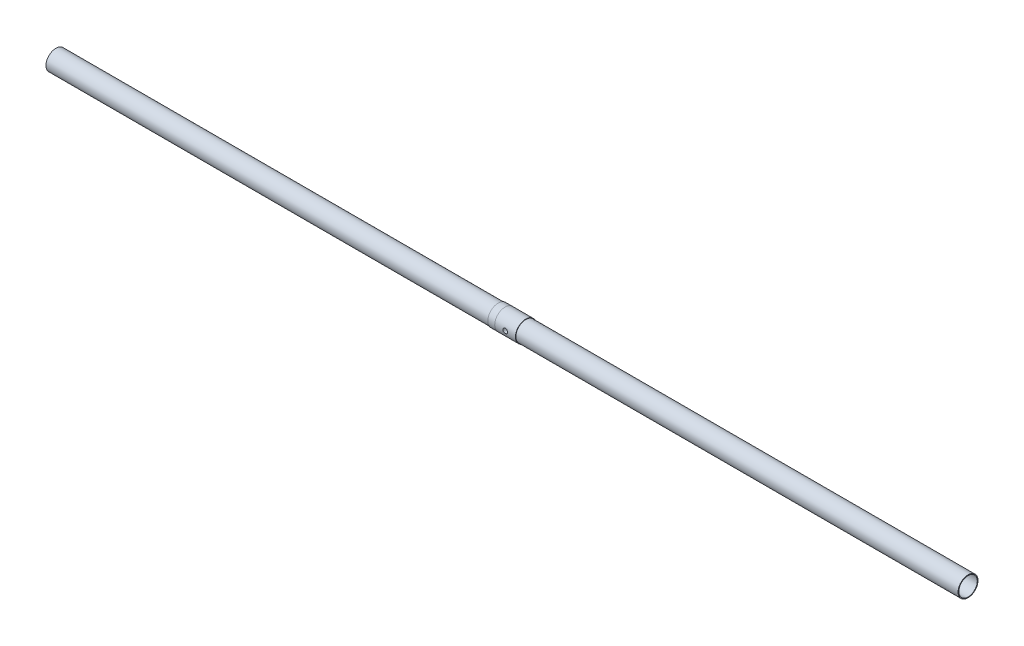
ISO-10303-21;
HEADER;
FILE_DESCRIPTION(('STEP AP214'),'2;1');
FILE_NAME('part.step','',(''),(''),'','','');
FILE_SCHEMA(('AUTOMOTIVE_DESIGN { 1 0 10303 214 1 1 1 1 }'));
ENDSEC;
DATA;
#1=APPLICATION_CONTEXT('core data for automotive mechanical design processes');
#2=APPLICATION_PROTOCOL_DEFINITION('international standard','automotive_design',2000,#1);
#3=PRODUCT_CONTEXT('',#1,'mechanical');
#4=PRODUCT('Part','Part','',(#3));
#5=PRODUCT_RELATED_PRODUCT_CATEGORY('part','',(#4));
#6=PRODUCT_DEFINITION_FORMATION('','',#4);
#7=PRODUCT_DEFINITION_CONTEXT('part definition',#1,'design');
#8=PRODUCT_DEFINITION('design','',#6,#7);
#9=PRODUCT_DEFINITION_SHAPE('','',#8);
#10=(LENGTH_UNIT() NAMED_UNIT(*) SI_UNIT(.MILLI.,.METRE.));
#11=(NAMED_UNIT(*) PLANE_ANGLE_UNIT() SI_UNIT($,.RADIAN.));
#12=(NAMED_UNIT(*) SI_UNIT($,.STERADIAN.) SOLID_ANGLE_UNIT());
#13=UNCERTAINTY_MEASURE_WITH_UNIT(LENGTH_MEASURE(1.E-05),#10,'distance_accuracy_value','');
#14=(GEOMETRIC_REPRESENTATION_CONTEXT(3) GLOBAL_UNCERTAINTY_ASSIGNED_CONTEXT((#13)) GLOBAL_UNIT_ASSIGNED_CONTEXT((#10,
#11,#12)) REPRESENTATION_CONTEXT('',''));
#15=CARTESIAN_POINT('',(0.,0.,0.));
#16=DIRECTION('',(0.,0.,1.));
#17=DIRECTION('',(1.,0.,0.));
#18=AXIS2_PLACEMENT_3D('',#15,#16,#17);
#19=CARTESIAN_POINT('',(88.9,0.,0.));
#20=DIRECTION('',(1.,0.,0.));
#21=DIRECTION('',(0.,0.,1.));
#22=AXIS2_PLACEMENT_3D('',#19,#20,#21);
#23=CYLINDRICAL_SURFACE('',#22,14.2875);
#24=CARTESIAN_POINT('',(20.6121,0.,14.2875));
#25=CARTESIAN_POINT('',(20.6121059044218,0.177394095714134,14.2874967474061));
#26=CARTESIAN_POINT('',(20.6268988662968,0.354858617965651,14.2841627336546));
#27=CARTESIAN_POINT('',(20.6856141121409,0.70473955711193,14.2711848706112));
#28=CARTESIAN_POINT('',(20.7295565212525,0.877152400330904,14.2615366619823));
#29=CARTESIAN_POINT('',(20.8451195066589,1.21182354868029,14.2370037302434));
#30=CARTESIAN_POINT('',(20.9167104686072,1.37409250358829,14.2221246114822));
#31=CARTESIAN_POINT('',(21.0854426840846,1.68431132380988,14.1887323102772));
#32=CARTESIAN_POINT('',(21.1825835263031,1.83226141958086,14.1702191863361));
#33=CARTESIAN_POINT('',(21.4013825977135,2.11213017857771,14.1312366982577));
#34=CARTESIAN_POINT('',(21.5233876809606,2.24377418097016,14.1107420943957));
#35=CARTESIAN_POINT('',(21.7877076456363,2.48491137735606,14.0702826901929));
#36=CARTESIAN_POINT('',(21.9300244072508,2.59440251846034,14.0503179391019));
#37=CARTESIAN_POINT('',(22.2329749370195,2.78935047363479,14.0129290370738));
#38=CARTESIAN_POINT('',(22.3938027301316,2.87451252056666,13.9955371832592));
#39=CARTESIAN_POINT('',(22.727941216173,3.01649331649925,13.9656265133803));
#40=CARTESIAN_POINT('',(22.9012503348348,3.07331563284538,13.9531070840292));
#41=CARTESIAN_POINT('',(23.2524456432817,3.15609155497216,13.9346162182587));
#42=CARTESIAN_POINT('',(23.4302113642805,3.18253270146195,13.9285414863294));
#43=CARTESIAN_POINT('',(23.7877514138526,3.20531211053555,13.9233177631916));
#44=CARTESIAN_POINT('',(23.9675254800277,3.20165426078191,13.9241678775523));
#45=CARTESIAN_POINT('',(24.3203370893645,3.1647313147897,13.9326043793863));
#46=CARTESIAN_POINT('',(24.4934377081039,3.1320348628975,13.9400613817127));
#47=CARTESIAN_POINT('',(24.831632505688,3.03886473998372,13.960666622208));
#48=CARTESIAN_POINT('',(24.9967262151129,2.97838944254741,13.9738151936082));
#49=CARTESIAN_POINT('',(25.3158075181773,2.83086225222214,14.0044481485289));
#50=CARTESIAN_POINT('',(25.4696914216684,2.74359368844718,14.0219676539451));
#51=CARTESIAN_POINT('',(25.7608404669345,2.54510940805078,14.0593472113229));
#52=CARTESIAN_POINT('',(25.8981032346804,2.43389027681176,14.0792075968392));
#53=CARTESIAN_POINT('',(26.155385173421,2.18766214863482,14.1195846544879));
#54=CARTESIAN_POINT('',(26.2749418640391,2.05217017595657,14.1401059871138));
#55=CARTESIAN_POINT('',(26.4897133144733,1.7628246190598,14.1790825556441));
#56=CARTESIAN_POINT('',(26.5849275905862,1.60897067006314,14.1975377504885));
#57=CARTESIAN_POINT('',(26.7484344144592,1.28668884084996,14.2303672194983));
#58=CARTESIAN_POINT('',(26.8166640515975,1.1182280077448,14.2447319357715));
#59=CARTESIAN_POINT('',(26.9237173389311,0.771838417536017,14.2676912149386));
#60=CARTESIAN_POINT('',(26.9625454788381,0.593911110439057,14.276286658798));
#61=CARTESIAN_POINT('',(27.0090155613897,0.237604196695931,14.2866127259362));
#62=CARTESIAN_POINT('',(27.0172889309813,0.0593108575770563,14.2884823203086));
#63=CARTESIAN_POINT('',(27.0041293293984,-0.296110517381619,14.2855364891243));
#64=CARTESIAN_POINT('',(26.9826984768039,-0.473238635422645,14.280721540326));
#65=CARTESIAN_POINT('',(26.9112619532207,-0.819193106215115,14.2650355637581));
#66=CARTESIAN_POINT('',(26.8615895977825,-0.98809177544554,14.2542352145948));
#67=CARTESIAN_POINT('',(26.7354517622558,-1.31515867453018,14.2277882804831));
#68=CARTESIAN_POINT('',(26.6589839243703,-1.47332595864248,14.2121412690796));
#69=CARTESIAN_POINT('',(26.4801249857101,-1.77703561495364,14.1773951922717));
#70=CARTESIAN_POINT('',(26.3773656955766,-1.92235556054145,14.158248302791));
#71=CARTESIAN_POINT('',(26.1493233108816,-2.19391526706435,14.1187200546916));
#72=CARTESIAN_POINT('',(26.0240371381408,-2.3201524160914,14.0983385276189));
#73=CARTESIAN_POINT('',(25.7515937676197,-2.55247678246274,14.0581547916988));
#74=CARTESIAN_POINT('',(25.6040595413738,-2.65812575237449,14.0383714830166));
#75=CARTESIAN_POINT('',(25.2929725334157,-2.84315107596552,14.0020739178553));
#76=CARTESIAN_POINT('',(25.1294204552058,-2.92252858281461,13.9855595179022));
#77=CARTESIAN_POINT('',(24.7918260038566,-3.05220940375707,13.9578320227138));
#78=CARTESIAN_POINT('',(24.6178500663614,-3.10267888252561,13.9465886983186));
#79=CARTESIAN_POINT('',(24.263601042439,-3.17359160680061,13.9306251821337));
#80=CARTESIAN_POINT('',(24.0833290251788,-3.19403992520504,13.9259038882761));
#81=CARTESIAN_POINT('',(23.7260298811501,-3.20410584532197,13.923590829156));
#82=CARTESIAN_POINT('',(23.5490230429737,-3.1944191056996,13.9258381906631));
#83=CARTESIAN_POINT('',(23.199233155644,-3.1460509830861,13.9368440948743));
#84=CARTESIAN_POINT('',(23.026450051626,-3.10736997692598,13.9456025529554));
#85=CARTESIAN_POINT('',(22.6905974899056,-3.00245477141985,13.9685635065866));
#86=CARTESIAN_POINT('',(22.5274934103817,-2.9363265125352,13.9827450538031));
#87=CARTESIAN_POINT('',(22.2145931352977,-2.77848325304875,14.0149615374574));
#88=CARTESIAN_POINT('',(22.0647984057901,-2.68676543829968,14.0329968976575));
#89=CARTESIAN_POINT('',(21.7793502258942,-2.4780595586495,14.0713659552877));
#90=CARTESIAN_POINT('',(21.6440631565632,-2.3605777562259,14.0917402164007));
#91=CARTESIAN_POINT('',(21.3948957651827,-2.10467339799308,14.132224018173));
#92=CARTESIAN_POINT('',(21.2810204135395,-1.96624599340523,14.1523334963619));
#93=CARTESIAN_POINT('',(21.0764046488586,-1.67008471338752,14.1903503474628));
#94=CARTESIAN_POINT('',(20.9860039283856,-1.51211151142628,14.2082236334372));
#95=CARTESIAN_POINT('',(20.833182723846,-1.18284156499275,14.2394098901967));
#96=CARTESIAN_POINT('',(20.7707393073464,-1.01155587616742,14.2527265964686));
#97=CARTESIAN_POINT('',(20.6864418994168,-0.700140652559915,14.2709871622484));
#98=CARTESIAN_POINT('',(20.6586179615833,-0.561666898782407,14.2771404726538));
#99=CARTESIAN_POINT('',(20.6214451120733,-0.282143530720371,14.2853980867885));
#100=CARTESIAN_POINT('',(20.6120953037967,-0.141094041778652,14.2875025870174));
#101=CARTESIAN_POINT('',(20.6121,0.,14.2875));
#102=B_SPLINE_CURVE_WITH_KNOTS('',3,(#24,#25,#26,#27,#28,#29,#30,#31,#32,#33,#34,#35,#36,#37,
#38,#39,#40,#41,#42,#43,#44,#45,#46,#47,#48,#49,#50,#51,#52,#53,#54,#55,#56,#57,#58,#59,#60,#61,
#62,#63,#64,#65,#66,#67,#68,#69,#70,#71,#72,#73,#74,#75,#76,#77,#78,#79,#80,#81,#82,#83,#84,#85,
#86,#87,#88,#89,#90,#91,#92,#93,#94,#95,#96,#97,#98,#99,#100,#101),.UNSPECIFIED.,.T.,.F.,(4,2,2,
2,2,2,2,2,2,2,2,2,2,2,2,2,2,2,2,2,2,2,2,2,2,2,2,2,2,2,2,2,2,2,2,2,2,2,4),(0.,0.531665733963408,
1.06369891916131,1.5951638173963,2.12662016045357,2.66607172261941,3.20557325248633,
3.75135808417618,4.29707419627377,4.8339049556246,5.37066637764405,5.89714296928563,
6.42365038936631,6.9545329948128,7.48549133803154,8.02850968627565,8.57153882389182,
9.11582659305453,9.66003123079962,10.1929246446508,10.7257800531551,11.2524733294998,
11.7792129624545,12.313776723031,12.848413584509,13.3934187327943,13.938399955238,
14.4802163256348,15.0219411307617,15.5512539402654,16.0805598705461,16.6078415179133,
17.1351811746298,17.6736814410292,18.212306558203,18.7583389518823,19.3039226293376,
19.7268144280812,20.1496857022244),.UNSPECIFIED.);
#103=CARTESIAN_POINT('',(20.6121,0.,14.2875));
#104=VERTEX_POINT('',#103);
#105=EDGE_CURVE('P0_E61',#104,#104,#102,.T.);
#106=ORIENTED_EDGE('',*,*,#105,.T.);
#107=EDGE_LOOP('',(#106));
#108=FACE_BOUND('',#107,.T.);
#109=CARTESIAN_POINT('',(20.6121,0.,-14.2875));
#110=CARTESIAN_POINT('',(20.6121059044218,-0.177394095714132,-14.2874967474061));
#111=CARTESIAN_POINT('',(20.6268988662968,-0.354858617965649,-14.2841627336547));
#112=CARTESIAN_POINT('',(20.6856141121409,-0.704739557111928,-14.2711848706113));
#113=CARTESIAN_POINT('',(20.7295565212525,-0.877152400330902,-14.2615366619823));
#114=CARTESIAN_POINT('',(20.8451195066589,-1.21182354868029,-14.2370037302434));
#115=CARTESIAN_POINT('',(20.9167104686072,-1.37409250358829,-14.2221246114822));
#116=CARTESIAN_POINT('',(21.0854426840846,-1.68431132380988,-14.1887323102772));
#117=CARTESIAN_POINT('',(21.1825835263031,-1.83226141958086,-14.1702191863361));
#118=CARTESIAN_POINT('',(21.4013825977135,-2.11213017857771,-14.1312366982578));
#119=CARTESIAN_POINT('',(21.5233876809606,-2.24377418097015,-14.1107420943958));
#120=CARTESIAN_POINT('',(21.7877076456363,-2.48491137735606,-14.0702826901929));
#121=CARTESIAN_POINT('',(21.9300244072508,-2.59440251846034,-14.0503179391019));
#122=CARTESIAN_POINT('',(22.2329749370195,-2.78935047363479,-14.0129290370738));
#123=CARTESIAN_POINT('',(22.3938027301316,-2.87451252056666,-13.9955371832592));
#124=CARTESIAN_POINT('',(22.727941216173,-3.01649331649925,-13.9656265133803));
#125=CARTESIAN_POINT('',(22.9012503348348,-3.07331563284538,-13.9531070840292));
#126=CARTESIAN_POINT('',(23.2524456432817,-3.15609155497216,-13.9346162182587));
#127=CARTESIAN_POINT('',(23.4302113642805,-3.18253270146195,-13.9285414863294));
#128=CARTESIAN_POINT('',(23.7877514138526,-3.20531211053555,-13.9233177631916));
#129=CARTESIAN_POINT('',(23.9675254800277,-3.20165426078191,-13.9241678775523));
#130=CARTESIAN_POINT('',(24.3203370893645,-3.1647313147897,-13.9326043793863));
#131=CARTESIAN_POINT('',(24.4934377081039,-3.13203486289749,-13.9400613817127));
#132=CARTESIAN_POINT('',(24.831632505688,-3.03886473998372,-13.960666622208));
#133=CARTESIAN_POINT('',(24.9967262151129,-2.97838944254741,-13.9738151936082));
#134=CARTESIAN_POINT('',(25.3158075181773,-2.83086225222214,-14.0044481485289));
#135=CARTESIAN_POINT('',(25.4696914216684,-2.74359368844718,-14.0219676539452));
#136=CARTESIAN_POINT('',(25.7608404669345,-2.54510940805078,-14.0593472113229));
#137=CARTESIAN_POINT('',(25.8981032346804,-2.43389027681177,-14.0792075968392));
#138=CARTESIAN_POINT('',(26.155385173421,-2.18766214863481,-14.1195846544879));
#139=CARTESIAN_POINT('',(26.2749418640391,-2.05217017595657,-14.1401059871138));
#140=CARTESIAN_POINT('',(26.4897133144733,-1.7628246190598,-14.1790825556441));
#141=CARTESIAN_POINT('',(26.5849275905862,-1.60897067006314,-14.1975377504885));
#142=CARTESIAN_POINT('',(26.7484344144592,-1.28668884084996,-14.2303672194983));
#143=CARTESIAN_POINT('',(26.8166640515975,-1.1182280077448,-14.2447319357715));
#144=CARTESIAN_POINT('',(26.9237173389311,-0.771838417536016,-14.2676912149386));
#145=CARTESIAN_POINT('',(26.9625454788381,-0.593911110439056,-14.276286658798));
#146=CARTESIAN_POINT('',(27.0090155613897,-0.237604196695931,-14.2866127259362));
#147=CARTESIAN_POINT('',(27.0172889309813,-0.0593108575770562,-14.2884823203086));
#148=CARTESIAN_POINT('',(27.0041293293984,0.296110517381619,-14.2855364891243));
#149=CARTESIAN_POINT('',(26.9826984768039,0.473238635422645,-14.280721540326));
#150=CARTESIAN_POINT('',(26.9112619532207,0.819193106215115,-14.2650355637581));
#151=CARTESIAN_POINT('',(26.8615895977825,0.988091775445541,-14.2542352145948));
#152=CARTESIAN_POINT('',(26.7354517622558,1.31515867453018,-14.2277882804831));
#153=CARTESIAN_POINT('',(26.6589839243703,1.47332595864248,-14.2121412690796));
#154=CARTESIAN_POINT('',(26.4801249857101,1.77703561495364,-14.1773951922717));
#155=CARTESIAN_POINT('',(26.3773656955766,1.92235556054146,-14.158248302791));
#156=CARTESIAN_POINT('',(26.1493233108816,2.19391526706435,-14.1187200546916));
#157=CARTESIAN_POINT('',(26.0240371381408,2.3201524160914,-14.0983385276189));
#158=CARTESIAN_POINT('',(25.7515937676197,2.55247678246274,-14.0581547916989));
#159=CARTESIAN_POINT('',(25.6040595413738,2.65812575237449,-14.0383714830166));
#160=CARTESIAN_POINT('',(25.2929725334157,2.84315107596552,-14.0020739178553));
#161=CARTESIAN_POINT('',(25.1294204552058,2.92252858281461,-13.9855595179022));
#162=CARTESIAN_POINT('',(24.7918260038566,3.05220940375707,-13.9578320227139));
#163=CARTESIAN_POINT('',(24.6178500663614,3.10267888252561,-13.9465886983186));
#164=CARTESIAN_POINT('',(24.263601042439,3.17359160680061,-13.9306251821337));
#165=CARTESIAN_POINT('',(24.0833290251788,3.19403992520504,-13.9259038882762));
#166=CARTESIAN_POINT('',(23.7260298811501,3.20410584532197,-13.923590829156));
#167=CARTESIAN_POINT('',(23.5490230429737,3.19441910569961,-13.9258381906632));
#168=CARTESIAN_POINT('',(23.199233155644,3.1460509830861,-13.9368440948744));
#169=CARTESIAN_POINT('',(23.026450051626,3.10736997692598,-13.9456025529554));
#170=CARTESIAN_POINT('',(22.6905974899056,3.00245477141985,-13.9685635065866));
#171=CARTESIAN_POINT('',(22.5274934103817,2.9363265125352,-13.9827450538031));
#172=CARTESIAN_POINT('',(22.2145931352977,2.77848325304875,-14.0149615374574));
#173=CARTESIAN_POINT('',(22.0647984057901,2.68676543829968,-14.0329968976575));
#174=CARTESIAN_POINT('',(21.7793502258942,2.4780595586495,-14.0713659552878));
#175=CARTESIAN_POINT('',(21.6440631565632,2.3605777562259,-14.0917402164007));
#176=CARTESIAN_POINT('',(21.3948957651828,2.10467339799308,-14.132224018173));
#177=CARTESIAN_POINT('',(21.2810204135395,1.96624599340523,-14.1523334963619));
#178=CARTESIAN_POINT('',(21.0764046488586,1.67008471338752,-14.1903503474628));
#179=CARTESIAN_POINT('',(20.9860039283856,1.51211151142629,-14.2082236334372));
#180=CARTESIAN_POINT('',(20.833182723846,1.18284156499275,-14.2394098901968));
#181=CARTESIAN_POINT('',(20.7707393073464,1.01155587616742,-14.2527265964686));
#182=CARTESIAN_POINT('',(20.6864418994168,0.700140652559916,-14.2709871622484));
#183=CARTESIAN_POINT('',(20.6586179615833,0.561666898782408,-14.2771404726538));
#184=CARTESIAN_POINT('',(20.6214451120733,0.282143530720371,-14.2853980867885));
#185=CARTESIAN_POINT('',(20.6120953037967,0.141094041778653,-14.2875025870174));
#186=CARTESIAN_POINT('',(20.6121,0.,-14.2875));
#187=B_SPLINE_CURVE_WITH_KNOTS('',3,(#109,#110,#111,#112,#113,#114,#115,#116,#117,#118,#119,
#120,#121,#122,#123,#124,#125,#126,#127,#128,#129,#130,#131,#132,#133,#134,#135,#136,#137,#138,
#139,#140,#141,#142,#143,#144,#145,#146,#147,#148,#149,#150,#151,#152,#153,#154,#155,#156,#157,
#158,#159,#160,#161,#162,#163,#164,#165,#166,#167,#168,#169,#170,#171,#172,#173,#174,#175,#176,
#177,#178,#179,#180,#181,#182,#183,#184,#185,#186),.UNSPECIFIED.,.T.,.F.,(4,2,2,2,2,2,2,2,2,2,2,
2,2,2,2,2,2,2,2,2,2,2,2,2,2,2,2,2,2,2,2,2,2,2,2,2,2,2,4),(0.,0.531665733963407,1.06369891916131,
1.59516381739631,2.12662016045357,2.66607172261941,3.20557325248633,3.75135808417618,
4.29707419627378,4.8339049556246,5.37066637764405,5.89714296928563,6.42365038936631,
6.9545329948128,7.48549133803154,8.02850968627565,8.57153882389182,9.11582659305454,
9.66003123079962,10.1929246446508,10.7257800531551,11.2524733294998,11.7792129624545,
12.313776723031,12.848413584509,13.3934187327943,13.938399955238,14.4802163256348,
15.0219411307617,15.5512539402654,16.0805598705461,16.6078415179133,17.1351811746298,
17.6736814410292,18.212306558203,18.7583389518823,19.3039226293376,19.7268144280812,
20.1496857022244),.UNSPECIFIED.);
#188=CARTESIAN_POINT('',(20.6121,0.,-14.2875));
#189=VERTEX_POINT('',#188);
#190=EDGE_CURVE('P0_E57',#189,#189,#187,.T.);
#191=ORIENTED_EDGE('',*,*,#190,.T.);
#192=EDGE_LOOP('',(#191));
#193=FACE_BOUND('',#192,.T.);
#194=CARTESIAN_POINT('',(38.1,0.,0.));
#195=DIRECTION('',(1.,0.,0.));
#196=DIRECTION('',(0.,0.,1.));
#197=AXIS2_PLACEMENT_3D('',#194,#195,#196);
#198=CIRCLE('',#197,14.2875);
#199=CARTESIAN_POINT('',(38.1,0.,14.2875));
#200=VERTEX_POINT('',#199);
#201=EDGE_CURVE('P0_E32',#200,#200,#198,.T.);
#202=ORIENTED_EDGE('',*,*,#201,.F.);
#203=EDGE_LOOP('',(#202));
#204=FACE_BOUND('',#203,.T.);
#205=CARTESIAN_POINT('',(9.525,0.,0.));
#206=DIRECTION('',(1.,0.,0.));
#207=DIRECTION('',(0.,0.,1.));
#208=AXIS2_PLACEMENT_3D('',#205,#206,#207);
#209=CIRCLE('',#208,14.2875);
#210=CARTESIAN_POINT('',(9.525,0.,14.2875));
#211=VERTEX_POINT('',#210);
#212=EDGE_CURVE('P0_E39',#211,#211,#209,.T.);
#213=ORIENTED_EDGE('',*,*,#212,.T.);
#214=EDGE_LOOP('',(#213));
#215=FACE_BOUND('',#214,.T.);
#216=ADVANCED_FACE('P0_F15',(#108,#193,#204,#215),#23,.T.);
#217=CARTESIAN_POINT('',(32.5671158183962,0.,0.));
#218=DIRECTION('',(1.,0.,0.));
#219=DIRECTION('',(0.,1.,0.));
#220=AXIS2_PLACEMENT_3D('',#217,#218,#219);
#221=CONICAL_SURFACE('',#220,0.,1.17809724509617);
#222=CARTESIAN_POINT('',(36.5125,0.,0.));
#223=DIRECTION('',(-1.,0.,0.));
#224=DIRECTION('',(0.,-1.,0.));
#225=AXIS2_PLACEMENT_3D('',#222,#223,#224);
#226=CIRCLE('',#225,9.52500000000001);
#227=CARTESIAN_POINT('',(36.5125,-9.52500000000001,0.));
#228=VERTEX_POINT('',#227);
#229=EDGE_CURVE('P0_E113',#228,#228,#226,.T.);
#230=ORIENTED_EDGE('',*,*,#229,.F.);
#231=EDGE_LOOP('',(#230));
#232=FACE_BOUND('',#231,.T.);
#233=CARTESIAN_POINT('',(35.8812385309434,0.,0.));
#234=DIRECTION('',(1.,0.,0.));
#235=DIRECTION('',(0.,1.,0.));
#236=AXIS2_PLACEMENT_3D('',#233,#234,#235);
#237=CIRCLE('',#236,8.001);
#238=CARTESIAN_POINT('',(35.8812385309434,8.001,0.));
#239=VERTEX_POINT('',#238);
#240=EDGE_CURVE('P0_E36',#239,#239,#237,.T.);
#241=ORIENTED_EDGE('',*,*,#240,.F.);
#242=EDGE_LOOP('',(#241));
#243=FACE_BOUND('',#242,.T.);
#244=ADVANCED_FACE('P0_F68',(#232,#243),#221,.F.);
#245=CARTESIAN_POINT('',(82.55,0.,0.));
#246=DIRECTION('',(1.,0.,0.));
#247=DIRECTION('',(0.,0.,1.));
#248=AXIS2_PLACEMENT_3D('',#245,#246,#247);
#249=DEGENERATE_TOROIDAL_SURFACE('',#248,12.954,25.4,.F.);
#250=CARTESIAN_POINT('',(82.55,0.,0.));
#251=DIRECTION('',(1.,0.,0.));
#252=DIRECTION('',(0.,0.,1.));
#253=AXIS2_PLACEMENT_3D('',#250,#251,#252);
#254=CIRCLE('',#253,12.446);
#255=CARTESIAN_POINT('',(82.55,0.,12.446));
#256=VERTEX_POINT('',#255);
#257=EDGE_CURVE('P0_E10',#256,#256,#254,.T.);
#258=ORIENTED_EDGE('',*,*,#257,.T.);
#259=EDGE_LOOP('',(#258));
#260=FACE_BOUND('',#259,.T.);
#261=CARTESIAN_POINT('',(88.9,0.,0.));
#262=DIRECTION('',(1.,0.,0.));
#263=DIRECTION('',(0.,0.,1.));
#264=AXIS2_PLACEMENT_3D('',#261,#262,#263);
#265=CIRCLE('',#264,11.6394442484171);
#266=CARTESIAN_POINT('',(88.9,0.,11.6394442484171));
#267=VERTEX_POINT('',#266);
#268=EDGE_CURVE('P0_E116',#267,#267,#265,.T.);
#269=ORIENTED_EDGE('',*,*,#268,.F.);
#270=EDGE_LOOP('',(#269));
#271=FACE_BOUND('',#270,.T.);
#272=ADVANCED_FACE('P0_F70',(#260,#271),#249,.F.);
#273=CARTESIAN_POINT('',(88.9,0.,0.));
#274=DIRECTION('',(1.,0.,0.));
#275=DIRECTION('',(0.,0.,1.));
#276=AXIS2_PLACEMENT_3D('',#273,#274,#275);
#277=CYLINDRICAL_SURFACE('',#276,12.446);
#278=CARTESIAN_POINT('',(38.1,0.,0.));
#279=DIRECTION('',(1.,0.,0.));
#280=DIRECTION('',(0.,0.,1.));
#281=AXIS2_PLACEMENT_3D('',#278,#279,#280);
#282=CIRCLE('',#281,12.446);
#283=CARTESIAN_POINT('',(38.1,0.,12.446));
#284=VERTEX_POINT('',#283);
#285=EDGE_CURVE('P0_E27',#284,#284,#282,.T.);
#286=ORIENTED_EDGE('',*,*,#285,.T.);
#287=EDGE_LOOP('',(#286));
#288=FACE_BOUND('',#287,.T.);
#289=ORIENTED_EDGE('',*,*,#257,.F.);
#290=EDGE_LOOP('',(#289));
#291=FACE_BOUND('',#290,.T.);
#292=ADVANCED_FACE('P0_F74',(#288,#291),#277,.T.);
#293=CARTESIAN_POINT('',(88.9,-14.2875,0.));
#294=DIRECTION('',(-1.,0.,0.));
#295=DIRECTION('',(0.,0.,-1.));
#296=AXIS2_PLACEMENT_3D('',#293,#294,#295);
#297=PLANE('',#296);
#298=CARTESIAN_POINT('',(88.9,0.,0.));
#299=DIRECTION('',(-1.,0.,0.));
#300=DIRECTION('',(0.,-1.,0.));
#301=AXIS2_PLACEMENT_3D('',#298,#299,#300);
#302=CIRCLE('',#301,9.525);
#303=CARTESIAN_POINT('',(88.9,-9.52500000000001,0.));
#304=VERTEX_POINT('',#303);
#305=EDGE_CURVE('P0_E38',#304,#304,#302,.T.);
#306=ORIENTED_EDGE('',*,*,#305,.T.);
#307=EDGE_LOOP('',(#306));
#308=FACE_BOUND('',#307,.T.);
#309=ORIENTED_EDGE('',*,*,#268,.T.);
#310=EDGE_LOOP('',(#309));
#311=FACE_BOUND('',#310,.T.);
#312=ADVANCED_FACE('P0_F17',(#308,#311),#297,.F.);
#313=CARTESIAN_POINT('',(32.5671158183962,0.,0.));
#314=DIRECTION('',(-1.,0.,0.));
#315=DIRECTION('',(0.,-1.,0.));
#316=AXIS2_PLACEMENT_3D('',#313,#314,#315);
#317=CYLINDRICAL_SURFACE('',#316,9.525);
#318=ORIENTED_EDGE('',*,*,#229,.T.);
#319=EDGE_LOOP('',(#318));
#320=FACE_BOUND('',#319,.T.);
#321=ORIENTED_EDGE('',*,*,#305,.F.);
#322=EDGE_LOOP('',(#321));
#323=FACE_BOUND('',#322,.T.);
#324=ADVANCED_FACE('P0_F81',(#320,#323),#317,.F.);
#325=CARTESIAN_POINT('',(38.1,0.,-12.446));
#326=DIRECTION('',(1.,0.,0.));
#327=DIRECTION('',(0.,0.,1.));
#328=AXIS2_PLACEMENT_3D('',#325,#326,#327);
#329=PLANE('',#328);
#330=ORIENTED_EDGE('',*,*,#285,.F.);
#331=EDGE_LOOP('',(#330));
#332=FACE_BOUND('',#331,.T.);
#333=ORIENTED_EDGE('',*,*,#201,.T.);
#334=EDGE_LOOP('',(#333));
#335=FACE_BOUND('',#334,.T.);
#336=ADVANCED_FACE('P0_F78',(#332,#335),#329,.T.);
#337=CARTESIAN_POINT('',(88.9,0.,0.));
#338=DIRECTION('',(1.,0.,0.));
#339=DIRECTION('',(0.,0.,1.));
#340=AXIS2_PLACEMENT_3D('',#337,#338,#339);
#341=CYLINDRICAL_SURFACE('',#340,8.001);
#342=CARTESIAN_POINT('',(20.6121,0.,8.00099999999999));
#343=CARTESIAN_POINT('',(20.6121017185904,0.0860515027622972,8.00099881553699));
#344=CARTESIAN_POINT('',(20.6155776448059,0.172132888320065,7.99960642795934));
#345=CARTESIAN_POINT('',(20.6294385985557,0.34366545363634,7.99407845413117));
#346=CARTESIAN_POINT('',(20.6398279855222,0.429116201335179,7.98994113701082));
#347=CARTESIAN_POINT('',(20.6813045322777,0.683922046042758,7.97352600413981));
#348=CARTESIAN_POINT('',(20.7226997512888,0.85147504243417,7.95724543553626));
#349=CARTESIAN_POINT('',(20.8311292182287,1.17611535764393,7.91577824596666));
#350=CARTESIAN_POINT('',(20.8980795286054,1.33323498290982,7.89062080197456));
#351=CARTESIAN_POINT('',(21.0553860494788,1.63390807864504,7.83388447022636));
#352=CARTESIAN_POINT('',(21.1457341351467,1.77746623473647,7.80230781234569));
#353=CARTESIAN_POINT('',(21.3517692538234,2.05386152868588,7.7342609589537));
#354=CARTESIAN_POINT('',(21.4683776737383,2.1859737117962,7.69763886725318));
#355=CARTESIAN_POINT('',(21.7216786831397,2.42938277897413,7.62432211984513));
#356=CARTESIAN_POINT('',(21.8583810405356,2.540669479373,7.58762743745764));
#357=CARTESIAN_POINT('',(22.1553777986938,2.74414252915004,7.51650412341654));
#358=CARTESIAN_POINT('',(22.31645139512,2.83525839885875,7.48224902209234));
#359=CARTESIAN_POINT('',(22.6532133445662,2.98878103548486,7.42226601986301));
#360=CARTESIAN_POINT('',(22.8288947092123,3.05120143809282,7.39653407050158));
#361=CARTESIAN_POINT('',(23.1815608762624,3.14263091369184,7.35814137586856));
#362=CARTESIAN_POINT('',(23.3581251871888,3.17302692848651,7.34494072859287));
#363=CARTESIAN_POINT('',(23.7143037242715,3.20387716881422,7.33154039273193));
#364=CARTESIAN_POINT('',(23.8939164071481,3.2043461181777,7.33133431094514));
#365=CARTESIAN_POINT('',(24.237763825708,3.17637998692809,7.34348582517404));
#366=CARTESIAN_POINT('',(24.402198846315,3.14995419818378,7.35497005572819));
#367=CARTESIAN_POINT('',(24.7240692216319,3.07229899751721,7.38774235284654));
#368=CARTESIAN_POINT('',(24.8815033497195,3.02106525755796,7.40903213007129));
#369=CARTESIAN_POINT('',(25.1887005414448,2.89427331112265,7.45948408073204));
#370=CARTESIAN_POINT('',(25.3382414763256,2.81824001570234,7.48879805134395));
#371=CARTESIAN_POINT('',(25.6229915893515,2.64434083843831,7.55195373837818));
#372=CARTESIAN_POINT('',(25.7581953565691,2.54646675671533,7.58579715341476));
#373=CARTESIAN_POINT('',(26.0214316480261,2.32277126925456,7.65738484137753));
#374=CARTESIAN_POINT('',(26.1481018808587,2.19537432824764,7.6952284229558));
#375=CARTESIAN_POINT('',(26.3787159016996,1.92074314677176,7.76832811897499));
#376=CARTESIAN_POINT('',(26.4826551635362,1.77350496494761,7.80358371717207));
#377=CARTESIAN_POINT('',(26.6666446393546,1.45950665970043,7.86841832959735));
#378=CARTESIAN_POINT('',(26.7461823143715,1.29241831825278,7.89787143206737));
#379=CARTESIAN_POINT('',(26.8755514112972,0.945756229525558,7.94683048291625));
#380=CARTESIAN_POINT('',(26.9253979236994,0.766188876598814,7.96634148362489));
#381=CARTESIAN_POINT('',(26.9912145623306,0.411084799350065,7.99229714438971));
#382=CARTESIAN_POINT('',(27.0090154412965,0.235938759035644,7.99944693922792));
#383=CARTESIAN_POINT('',(27.0156413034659,-0.11496686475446,8.00209579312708));
#384=CARTESIAN_POINT('',(27.0044737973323,-0.290726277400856,7.99759787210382));
#385=CARTESIAN_POINT('',(26.9548259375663,-0.629571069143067,7.97791818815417));
#386=CARTESIAN_POINT('',(26.9175953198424,-0.792871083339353,7.96322554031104));
#387=CARTESIAN_POINT('',(26.8185785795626,-1.11075551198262,7.92514158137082));
#388=CARTESIAN_POINT('',(26.7567893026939,-1.2653388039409,7.90174915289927));
#389=CARTESIAN_POINT('',(26.6083935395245,-1.56672187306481,7.84764634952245));
#390=CARTESIAN_POINT('',(26.5210857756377,-1.7131389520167,7.8167340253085));
#391=CARTESIAN_POINT('',(26.324909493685,-1.98975843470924,7.75094258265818));
#392=CARTESIAN_POINT('',(26.2160323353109,-2.11995430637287,7.71606187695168));
#393=CARTESIAN_POINT('',(25.9713778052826,-2.36945301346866,7.64327717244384));
#394=CARTESIAN_POINT('',(25.8342990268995,-2.48746918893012,7.60532560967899));
#395=CARTESIAN_POINT('',(25.5416119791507,-2.69913926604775,7.53280825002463));
#396=CARTESIAN_POINT('',(25.3860006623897,-2.79278915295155,7.49824301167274));
#397=CARTESIAN_POINT('',(25.0583169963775,-2.95366116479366,7.43635822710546));
#398=CARTESIAN_POINT('',(24.8860997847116,-3.02061848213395,7.40911211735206));
#399=CARTESIAN_POINT('',(24.5314160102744,-3.12406441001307,7.36609942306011));
#400=CARTESIAN_POINT('',(24.3489571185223,-3.16057550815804,7.35032436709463));
#401=CARTESIAN_POINT('',(23.9931179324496,-3.19994493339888,7.33326469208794));
#402=CARTESIAN_POINT('',(23.8200292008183,-3.20503592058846,7.33101899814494));
#403=CARTESIAN_POINT('',(23.475586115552,-3.18728340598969,7.33875460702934));
#404=CARTESIAN_POINT('',(23.3042315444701,-3.16444345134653,7.34873435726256));
#405=CARTESIAN_POINT('',(22.9750638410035,-3.0933008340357,7.37894863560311));
#406=CARTESIAN_POINT('',(22.8169831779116,-3.04604082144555,7.39876202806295));
#407=CARTESIAN_POINT('',(22.5109314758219,-2.92837459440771,7.44611467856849));
#408=CARTESIAN_POINT('',(22.3629632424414,-2.85796198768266,7.47365606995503));
#409=CARTESIAN_POINT('',(22.0721072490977,-2.69133328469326,7.53531950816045));
#410=CARTESIAN_POINT('',(21.9299954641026,-2.59387060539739,7.56972805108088));
#411=CARTESIAN_POINT('',(21.663441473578,-2.37772269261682,7.64037596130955));
#412=CARTESIAN_POINT('',(21.5390046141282,-2.25903106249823,7.6766158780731));
#413=CARTESIAN_POINT('',(21.3030642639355,-1.9946655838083,7.74966500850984));
#414=CARTESIAN_POINT('',(21.1929223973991,-1.84774126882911,7.78635879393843));
#415=CARTESIAN_POINT('',(20.9987995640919,-1.53600374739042,7.85379061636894));
#416=CARTESIAN_POINT('',(20.9148307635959,-1.37118226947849,7.88452588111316));
#417=CARTESIAN_POINT('',(20.8115131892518,-1.11575594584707,7.92328178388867));
#418=CARTESIAN_POINT('',(20.7810214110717,-1.03004942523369,7.93490376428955));
#419=CARTESIAN_POINT('',(20.7273809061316,-0.856077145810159,7.95555030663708));
#420=CARTESIAN_POINT('',(20.704228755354,-0.767812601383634,7.9645760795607));
#421=CARTESIAN_POINT('',(20.6655658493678,-0.589628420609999,7.97974447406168));
#422=CARTESIAN_POINT('',(20.6500357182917,-0.499713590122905,7.98589440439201));
#423=CARTESIAN_POINT('',(20.626711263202,-0.318775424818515,7.99515937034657));
#424=CARTESIAN_POINT('',(20.618911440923,-0.227752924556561,7.9982765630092));
#425=CARTESIAN_POINT('',(20.6130712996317,-0.091075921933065,8.00061158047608));
#426=CARTESIAN_POINT('',(20.6120990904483,-0.0455421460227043,8.00100062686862));
#427=CARTESIAN_POINT('',(20.6121,0.,8.00099999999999));
#428=B_SPLINE_CURVE_WITH_KNOTS('',3,(#342,#343,#344,#345,#346,#347,#348,#349,#350,#351,#352,
#353,#354,#355,#356,#357,#358,#359,#360,#361,#362,#363,#364,#365,#366,#367,#368,#369,#370,#371,
#372,#373,#374,#375,#376,#377,#378,#379,#380,#381,#382,#383,#384,#385,#386,#387,#388,#389,#390,
#391,#392,#393,#394,#395,#396,#397,#398,#399,#400,#401,#402,#403,#404,#405,#406,#407,#408,#409,
#410,#411,#412,#413,#414,#415,#416,#417,#418,#419,#420,#421,#422,#423,#424,#425,#426,#427),
.UNSPECIFIED.,.T.,.F.,(4,2,2,2,2,2,2,2,2,2,2,2,2,2,2,2,2,2,2,2,2,2,2,2,2,2,2,2,2,2,2,2,2,2,2,2,
2,2,2,2,2,2,4),(0.,0.258115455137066,0.516393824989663,1.03370751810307,1.5493364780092,
2.06478662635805,2.60236786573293,3.14021129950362,3.70199133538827,4.26350414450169,
4.79955005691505,5.33533223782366,5.8338268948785,6.33240855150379,6.84116556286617,
7.35011390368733,7.89840526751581,8.44680570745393,9.00604072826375,9.56499127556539,
10.0908526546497,10.616577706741,11.1186814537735,11.6208497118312,12.1383778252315,
12.656113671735,13.2080308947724,13.7600389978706,14.317394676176,14.8743383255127,
15.3912029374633,15.9080019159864,16.4043638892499,16.9008630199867,17.4257899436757,
17.9508753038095,18.510004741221,19.0693936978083,19.3442182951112,19.6189144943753,
19.8929087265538,20.1667079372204,20.3033137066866),.UNSPECIFIED.);
#429=CARTESIAN_POINT('',(20.6121,0.,8.00099999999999));
#430=VERTEX_POINT('',#429);
#431=EDGE_CURVE('P0_E19',#430,#430,#428,.T.);
#432=ORIENTED_EDGE('',*,*,#431,.F.);
#433=EDGE_LOOP('',(#432));
#434=FACE_BOUND('',#433,.T.);
#435=CARTESIAN_POINT('',(20.6121,0.,-8.00100000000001));
#436=CARTESIAN_POINT('',(20.6121017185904,-0.086051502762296,-8.00099881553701));
#437=CARTESIAN_POINT('',(20.6155776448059,-0.172132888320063,-7.99960642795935));
#438=CARTESIAN_POINT('',(20.6294385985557,-0.343665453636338,-7.99407845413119));
#439=CARTESIAN_POINT('',(20.6398279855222,-0.429116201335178,-7.98994113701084));
#440=CARTESIAN_POINT('',(20.6813045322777,-0.683922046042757,-7.97352600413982));
#441=CARTESIAN_POINT('',(20.7226997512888,-0.851475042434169,-7.95724543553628));
#442=CARTESIAN_POINT('',(20.8311292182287,-1.17611535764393,-7.91577824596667));
#443=CARTESIAN_POINT('',(20.8980795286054,-1.33323498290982,-7.89062080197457));
#444=CARTESIAN_POINT('',(21.0553860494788,-1.63390807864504,-7.83388447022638));
#445=CARTESIAN_POINT('',(21.1457341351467,-1.77746623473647,-7.8023078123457));
#446=CARTESIAN_POINT('',(21.3517692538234,-2.05386152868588,-7.73426095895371));
#447=CARTESIAN_POINT('',(21.4683776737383,-2.18597371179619,-7.6976388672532));
#448=CARTESIAN_POINT('',(21.7216786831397,-2.42938277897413,-7.62432211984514));
#449=CARTESIAN_POINT('',(21.8583810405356,-2.54066947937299,-7.58762743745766));
#450=CARTESIAN_POINT('',(22.1553777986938,-2.74414252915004,-7.51650412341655));
#451=CARTESIAN_POINT('',(22.31645139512,-2.83525839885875,-7.48224902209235));
#452=CARTESIAN_POINT('',(22.6532133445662,-2.98878103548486,-7.42226601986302));
#453=CARTESIAN_POINT('',(22.8288947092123,-3.05120143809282,-7.39653407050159));
#454=CARTESIAN_POINT('',(23.1815608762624,-3.14263091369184,-7.35814137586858));
#455=CARTESIAN_POINT('',(23.3581251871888,-3.17302692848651,-7.34494072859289));
#456=CARTESIAN_POINT('',(23.7143037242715,-3.20387716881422,-7.33154039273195));
#457=CARTESIAN_POINT('',(23.8939164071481,-3.2043461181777,-7.33133431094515));
#458=CARTESIAN_POINT('',(24.237763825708,-3.17637998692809,-7.34348582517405));
#459=CARTESIAN_POINT('',(24.402198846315,-3.14995419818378,-7.35497005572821));
#460=CARTESIAN_POINT('',(24.7240692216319,-3.07229899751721,-7.38774235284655));
#461=CARTESIAN_POINT('',(24.8815033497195,-3.02106525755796,-7.4090321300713));
#462=CARTESIAN_POINT('',(25.1887005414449,-2.89427331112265,-7.45948408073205));
#463=CARTESIAN_POINT('',(25.3382414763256,-2.81824001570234,-7.48879805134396));
#464=CARTESIAN_POINT('',(25.6229915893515,-2.64434083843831,-7.5519537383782));
#465=CARTESIAN_POINT('',(25.7581953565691,-2.54646675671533,-7.58579715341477));
#466=CARTESIAN_POINT('',(26.0214316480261,-2.32277126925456,-7.65738484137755));
#467=CARTESIAN_POINT('',(26.1481018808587,-2.19537432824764,-7.69522842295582));
#468=CARTESIAN_POINT('',(26.3787159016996,-1.92074314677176,-7.768328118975));
#469=CARTESIAN_POINT('',(26.4826551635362,-1.77350496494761,-7.80358371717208));
#470=CARTESIAN_POINT('',(26.6666446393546,-1.45950665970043,-7.86841832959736));
#471=CARTESIAN_POINT('',(26.7461823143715,-1.29241831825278,-7.89787143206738));
#472=CARTESIAN_POINT('',(26.8755514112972,-0.945756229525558,-7.94683048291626));
#473=CARTESIAN_POINT('',(26.9253979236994,-0.766188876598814,-7.9663414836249));
#474=CARTESIAN_POINT('',(26.9912145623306,-0.411084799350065,-7.99229714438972));
#475=CARTESIAN_POINT('',(27.0090154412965,-0.235938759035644,-7.99944693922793));
#476=CARTESIAN_POINT('',(27.0156413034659,0.11496686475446,-8.00209579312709));
#477=CARTESIAN_POINT('',(27.0044737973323,0.290726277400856,-7.99759787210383));
#478=CARTESIAN_POINT('',(26.9548259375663,0.629571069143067,-7.97791818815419));
#479=CARTESIAN_POINT('',(26.9175953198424,0.792871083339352,-7.96322554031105));
#480=CARTESIAN_POINT('',(26.8185785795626,1.11075551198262,-7.92514158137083));
#481=CARTESIAN_POINT('',(26.7567893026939,1.2653388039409,-7.90174915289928));
#482=CARTESIAN_POINT('',(26.6083935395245,1.56672187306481,-7.84764634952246));
#483=CARTESIAN_POINT('',(26.5210857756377,1.7131389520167,-7.81673402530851));
#484=CARTESIAN_POINT('',(26.324909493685,1.98975843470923,-7.7509425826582));
#485=CARTESIAN_POINT('',(26.2160323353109,2.11995430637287,-7.7160618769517));
#486=CARTESIAN_POINT('',(25.9713778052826,2.36945301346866,-7.64327717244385));
#487=CARTESIAN_POINT('',(25.8342990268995,2.48746918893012,-7.605325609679));
#488=CARTESIAN_POINT('',(25.5416119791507,2.69913926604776,-7.53280825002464));
#489=CARTESIAN_POINT('',(25.3860006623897,2.79278915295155,-7.49824301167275));
#490=CARTESIAN_POINT('',(25.0583169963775,2.95366116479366,-7.43635822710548));
#491=CARTESIAN_POINT('',(24.8860997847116,3.02061848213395,-7.40911211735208));
#492=CARTESIAN_POINT('',(24.5314160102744,3.12406441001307,-7.36609942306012));
#493=CARTESIAN_POINT('',(24.3489571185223,3.16057550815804,-7.35032436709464));
#494=CARTESIAN_POINT('',(23.9931179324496,3.19994493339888,-7.33326469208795));
#495=CARTESIAN_POINT('',(23.8200292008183,3.20503592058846,-7.33101899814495));
#496=CARTESIAN_POINT('',(23.475586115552,3.18728340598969,-7.33875460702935));
#497=CARTESIAN_POINT('',(23.3042315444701,3.16444345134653,-7.34873435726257));
#498=CARTESIAN_POINT('',(22.9750638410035,3.0933008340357,-7.37894863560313));
#499=CARTESIAN_POINT('',(22.8169831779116,3.04604082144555,-7.39876202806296));
#500=CARTESIAN_POINT('',(22.5109314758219,2.92837459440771,-7.4461146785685));
#501=CARTESIAN_POINT('',(22.3629632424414,2.85796198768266,-7.47365606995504));
#502=CARTESIAN_POINT('',(22.0721072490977,2.69133328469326,-7.53531950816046));
#503=CARTESIAN_POINT('',(21.9299954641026,2.59387060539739,-7.56972805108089));
#504=CARTESIAN_POINT('',(21.663441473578,2.37772269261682,-7.64037596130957));
#505=CARTESIAN_POINT('',(21.5390046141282,2.25903106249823,-7.67661587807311));
#506=CARTESIAN_POINT('',(21.3030642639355,1.9946655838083,-7.74966500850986));
#507=CARTESIAN_POINT('',(21.1929223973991,1.84774126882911,-7.78635879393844));
#508=CARTESIAN_POINT('',(20.9987995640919,1.53600374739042,-7.85379061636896));
#509=CARTESIAN_POINT('',(20.9148307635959,1.37118226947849,-7.88452588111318));
#510=CARTESIAN_POINT('',(20.8115131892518,1.11575594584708,-7.92328178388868));
#511=CARTESIAN_POINT('',(20.7810214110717,1.03004942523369,-7.93490376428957));
#512=CARTESIAN_POINT('',(20.7273809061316,0.856077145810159,-7.95555030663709));
#513=CARTESIAN_POINT('',(20.704228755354,0.767812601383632,-7.96457607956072));
#514=CARTESIAN_POINT('',(20.6655658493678,0.589628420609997,-7.9797444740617));
#515=CARTESIAN_POINT('',(20.6500357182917,0.499713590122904,-7.98589440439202));
#516=CARTESIAN_POINT('',(20.626711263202,0.318775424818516,-7.99515937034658));
#517=CARTESIAN_POINT('',(20.618911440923,0.227752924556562,-7.99827656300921));
#518=CARTESIAN_POINT('',(20.6130712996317,0.0910759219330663,-8.0006115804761));
#519=CARTESIAN_POINT('',(20.6120990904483,0.0455421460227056,-8.00100062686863));
#520=CARTESIAN_POINT('',(20.6121,0.,-8.00100000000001));
#521=B_SPLINE_CURVE_WITH_KNOTS('',3,(#435,#436,#437,#438,#439,#440,#441,#442,#443,#444,#445,
#446,#447,#448,#449,#450,#451,#452,#453,#454,#455,#456,#457,#458,#459,#460,#461,#462,#463,#464,
#465,#466,#467,#468,#469,#470,#471,#472,#473,#474,#475,#476,#477,#478,#479,#480,#481,#482,#483,
#484,#485,#486,#487,#488,#489,#490,#491,#492,#493,#494,#495,#496,#497,#498,#499,#500,#501,#502,
#503,#504,#505,#506,#507,#508,#509,#510,#511,#512,#513,#514,#515,#516,#517,#518,#519,#520),
.UNSPECIFIED.,.T.,.F.,(4,2,2,2,2,2,2,2,2,2,2,2,2,2,2,2,2,2,2,2,2,2,2,2,2,2,2,2,2,2,2,2,2,2,2,2,
2,2,2,2,2,2,4),(0.,0.258115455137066,0.516393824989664,1.03370751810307,1.5493364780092,
2.06478662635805,2.60236786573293,3.14021129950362,3.70199133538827,4.26350414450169,
4.79955005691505,5.33533223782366,5.8338268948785,6.33240855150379,6.84116556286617,
7.35011390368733,7.89840526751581,8.44680570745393,9.00604072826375,9.56499127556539,
10.0908526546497,10.616577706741,11.1186814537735,11.6208497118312,12.1383778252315,
12.656113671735,13.2080308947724,13.7600389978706,14.317394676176,14.8743383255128,
15.3912029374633,15.9080019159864,16.4043638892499,16.9008630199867,17.4257899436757,
17.9508753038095,18.510004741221,19.0693936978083,19.3442182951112,19.6189144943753,
19.8929087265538,20.1667079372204,20.3033137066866),.UNSPECIFIED.);
#522=CARTESIAN_POINT('',(20.6121,0.,-8.00100000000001));
#523=VERTEX_POINT('',#522);
#524=EDGE_CURVE('P0_E40',#523,#523,#521,.T.);
#525=ORIENTED_EDGE('',*,*,#524,.F.);
#526=EDGE_LOOP('',(#525));
#527=FACE_BOUND('',#526,.T.);
#528=CARTESIAN_POINT('',(12.7,0.,0.));
#529=DIRECTION('',(1.,0.,0.));
#530=DIRECTION('',(0.,0.,1.));
#531=AXIS2_PLACEMENT_3D('',#528,#529,#530);
#532=CIRCLE('',#531,8.001);
#533=CARTESIAN_POINT('',(12.7,0.,8.00099999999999));
#534=VERTEX_POINT('',#533);
#535=EDGE_CURVE('P0_E103',#534,#534,#532,.T.);
#536=ORIENTED_EDGE('',*,*,#535,.F.);
#537=EDGE_LOOP('',(#536));
#538=FACE_BOUND('',#537,.T.);
#539=ORIENTED_EDGE('',*,*,#240,.T.);
#540=EDGE_LOOP('',(#539));
#541=FACE_BOUND('',#540,.T.);
#542=ADVANCED_FACE('P0_F44',(#434,#527,#538,#541),#341,.F.);
#543=CARTESIAN_POINT('',(9.52500000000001,-14.2875,0.));
#544=DIRECTION('',(-1.,0.,0.));
#545=DIRECTION('',(0.,0.,-1.));
#546=AXIS2_PLACEMENT_3D('',#543,#544,#545);
#547=PLANE('',#546);
#548=CARTESIAN_POINT('',(9.52500000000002,0.,0.));
#549=DIRECTION('',(1.,0.,0.));
#550=DIRECTION('',(0.,0.,1.));
#551=AXIS2_PLACEMENT_3D('',#548,#549,#550);
#552=CIRCLE('',#551,11.176);
#553=CARTESIAN_POINT('',(9.52500000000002,0.,11.176));
#554=VERTEX_POINT('',#553);
#555=EDGE_CURVE('P0_E106',#554,#554,#552,.T.);
#556=ORIENTED_EDGE('',*,*,#555,.T.);
#557=EDGE_LOOP('',(#556));
#558=FACE_BOUND('',#557,.T.);
#559=ORIENTED_EDGE('',*,*,#212,.F.);
#560=EDGE_LOOP('',(#559));
#561=FACE_BOUND('',#560,.T.);
#562=ADVANCED_FACE('P0_F89',(#558,#561),#547,.T.);
#563=CARTESIAN_POINT('',(9.52500000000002,0.,0.));
#564=DIRECTION('',(-1.,0.,0.));
#565=DIRECTION('',(0.,0.,-1.));
#566=AXIS2_PLACEMENT_3D('',#563,#564,#565);
#567=CONICAL_SURFACE('',#566,11.176,0.785398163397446);
#568=ORIENTED_EDGE('',*,*,#535,.T.);
#569=EDGE_LOOP('',(#568));
#570=FACE_BOUND('',#569,.T.);
#571=ORIENTED_EDGE('',*,*,#555,.F.);
#572=EDGE_LOOP('',(#571));
#573=FACE_BOUND('',#572,.T.);
#574=ADVANCED_FACE('P0_F91',(#570,#573),#567,.F.);
#575=CARTESIAN_POINT('',(23.8125,0.,-25.4));
#576=DIRECTION('',(0.,0.,1.));
#577=DIRECTION('',(-1.,0.,0.));
#578=AXIS2_PLACEMENT_3D('',#575,#576,#577);
#579=CYLINDRICAL_SURFACE('',#578,3.2004);
#580=ORIENTED_EDGE('',*,*,#524,.T.);
#581=EDGE_LOOP('',(#580));
#582=FACE_BOUND('',#581,.T.);
#583=ORIENTED_EDGE('',*,*,#190,.F.);
#584=EDGE_LOOP('',(#583));
#585=FACE_BOUND('',#584,.T.);
#586=ADVANCED_FACE('P0_F50',(#582,#585),#579,.F.);
#587=ORIENTED_EDGE('',*,*,#431,.T.);
#588=EDGE_LOOP('',(#587));
#589=FACE_BOUND('',#588,.T.);
#590=ORIENTED_EDGE('',*,*,#105,.F.);
#591=EDGE_LOOP('',(#590));
#592=FACE_BOUND('',#591,.T.);
#593=ADVANCED_FACE('P0_F47',(#589,#592),#579,.F.);
#594=CLOSED_SHELL('',(#216,#244,#272,#292,#312,#324,#336,#542,#562,#574,#586,#593));
#595=MANIFOLD_SOLID_BREP('P0_B1',#594);
#596=CARTESIAN_POINT('',(-50.8,0.,0.));
#597=DIRECTION('',(-1.,0.,0.));
#598=DIRECTION('',(0.,0.,1.));
#599=AXIS2_PLACEMENT_3D('',#596,#597,#598);
#600=CYLINDRICAL_SURFACE('',#599,14.2875);
#601=CARTESIAN_POINT('',(0.,0.,0.));
#602=DIRECTION('',(-1.,0.,0.));
#603=DIRECTION('',(0.,0.,1.));
#604=AXIS2_PLACEMENT_3D('',#601,#602,#603);
#605=CIRCLE('',#604,14.2875);
#606=CARTESIAN_POINT('',(0.,0.,14.2875));
#607=VERTEX_POINT('',#606);
#608=EDGE_CURVE('P1_E78',#607,#607,#605,.T.);
#609=ORIENTED_EDGE('',*,*,#608,.F.);
#610=EDGE_LOOP('',(#609));
#611=FACE_BOUND('',#610,.T.);
#612=CARTESIAN_POINT('',(9.525,0.,0.));
#613=DIRECTION('',(-1.,0.,0.));
#614=DIRECTION('',(0.,-1.,0.));
#615=AXIS2_PLACEMENT_3D('',#612,#613,#614);
#616=CIRCLE('',#615,14.2875);
#617=CARTESIAN_POINT('',(9.525,-14.2875,0.));
#618=VERTEX_POINT('',#617);
#619=EDGE_CURVE('P1_E113',#618,#618,#616,.T.);
#620=ORIENTED_EDGE('',*,*,#619,.T.);
#621=EDGE_LOOP('',(#620));
#622=FACE_BOUND('',#621,.T.);
#623=ADVANCED_FACE('P1_F17',(#611,#622),#600,.T.);
#624=CARTESIAN_POINT('',(-50.8,0.,0.));
#625=DIRECTION('',(-1.,0.,0.));
#626=DIRECTION('',(0.,0.,1.));
#627=AXIS2_PLACEMENT_3D('',#624,#625,#626);
#628=CYLINDRICAL_SURFACE('',#627,12.446);
#629=CARTESIAN_POINT('',(0.,0.,0.));
#630=DIRECTION('',(-1.,0.,0.));
#631=DIRECTION('',(0.,0.,1.));
#632=AXIS2_PLACEMENT_3D('',#629,#630,#631);
#633=CIRCLE('',#632,12.446);
#634=CARTESIAN_POINT('',(0.,0.,12.446));
#635=VERTEX_POINT('',#634);
#636=EDGE_CURVE('P1_E29',#635,#635,#633,.T.);
#637=ORIENTED_EDGE('',*,*,#636,.T.);
#638=EDGE_LOOP('',(#637));
#639=FACE_BOUND('',#638,.T.);
#640=CARTESIAN_POINT('',(-44.45,0.,0.));
#641=DIRECTION('',(-1.,0.,0.));
#642=DIRECTION('',(0.,0.,1.));
#643=AXIS2_PLACEMENT_3D('',#640,#641,#642);
#644=CIRCLE('',#643,12.446);
#645=CARTESIAN_POINT('',(-44.45,0.,12.446));
#646=VERTEX_POINT('',#645);
#647=EDGE_CURVE('P1_E11',#646,#646,#644,.T.);
#648=ORIENTED_EDGE('',*,*,#647,.F.);
#649=EDGE_LOOP('',(#648));
#650=FACE_BOUND('',#649,.T.);
#651=ADVANCED_FACE('P1_F51',(#639,#650),#628,.T.);
#652=CARTESIAN_POINT('',(0.,0.,-12.446));
#653=DIRECTION('',(-1.,0.,0.));
#654=DIRECTION('',(0.,0.,1.));
#655=AXIS2_PLACEMENT_3D('',#652,#653,#654);
#656=PLANE('',#655);
#657=ORIENTED_EDGE('',*,*,#636,.F.);
#658=EDGE_LOOP('',(#657));
#659=FACE_BOUND('',#658,.T.);
#660=ORIENTED_EDGE('',*,*,#608,.T.);
#661=EDGE_LOOP('',(#660));
#662=FACE_BOUND('',#661,.T.);
#663=ADVANCED_FACE('P1_F56',(#659,#662),#656,.T.);
#664=CARTESIAN_POINT('',(41.275,5.55625000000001,0.));
#665=DIRECTION('',(1.,0.,0.));
#666=DIRECTION('',(0.,1.,0.));
#667=AXIS2_PLACEMENT_3D('',#664,#665,#666);
#668=PLANE('',#667);
#669=CARTESIAN_POINT('',(41.275,0.,0.));
#670=DIRECTION('',(-1.,0.,0.));
#671=DIRECTION('',(0.,-1.,0.));
#672=AXIS2_PLACEMENT_3D('',#669,#670,#671);
#673=CIRCLE('',#672,5.55625);
#674=CARTESIAN_POINT('',(41.275,-5.55625,0.));
#675=VERTEX_POINT('',#674);
#676=EDGE_CURVE('P1_E122',#675,#675,#673,.T.);
#677=ORIENTED_EDGE('',*,*,#676,.F.);
#678=EDGE_LOOP('',(#677));
#679=FACE_BOUND('',#678,.T.);
#680=ADVANCED_FACE('P1_F66',(#679),#668,.T.);
#681=CARTESIAN_POINT('',(38.89375,0.,0.));
#682=DIRECTION('',(-1.,0.,0.));
#683=DIRECTION('',(0.,-1.,0.));
#684=AXIS2_PLACEMENT_3D('',#681,#682,#683);
#685=CONICAL_SURFACE('',#684,7.9375,0.785398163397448);
#686=ORIENTED_EDGE('',*,*,#676,.T.);
#687=EDGE_LOOP('',(#686));
#688=FACE_BOUND('',#687,.T.);
#689=CARTESIAN_POINT('',(38.89375,0.,0.));
#690=DIRECTION('',(-1.,0.,0.));
#691=DIRECTION('',(0.,-1.,0.));
#692=AXIS2_PLACEMENT_3D('',#689,#690,#691);
#693=CIRCLE('',#692,7.9375);
#694=CARTESIAN_POINT('',(38.89375,-7.9375,0.));
#695=VERTEX_POINT('',#694);
#696=EDGE_CURVE('P1_E115',#695,#695,#693,.T.);
#697=ORIENTED_EDGE('',*,*,#696,.F.);
#698=EDGE_LOOP('',(#697));
#699=FACE_BOUND('',#698,.T.);
#700=ADVANCED_FACE('P1_F71',(#688,#699),#685,.T.);
#701=CARTESIAN_POINT('',(41.275,0.,0.));
#702=DIRECTION('',(-1.,0.,0.));
#703=DIRECTION('',(0.,-1.,0.));
#704=AXIS2_PLACEMENT_3D('',#701,#702,#703);
#705=CYLINDRICAL_SURFACE('',#704,7.9375);
#706=CARTESIAN_POINT('',(27.0129,0.,-7.9375));
#707=CARTESIAN_POINT('',(27.0128982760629,-0.0859967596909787,-7.93749880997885));
#708=CARTESIAN_POINT('',(27.0094268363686,-0.172021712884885,-7.9360971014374));
#709=CARTESIAN_POINT('',(26.9955840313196,-0.343441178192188,-7.93053212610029));
#710=CARTESIAN_POINT('',(26.9852083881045,-0.428835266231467,-7.92636714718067));
#711=CARTESIAN_POINT('',(26.9437880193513,-0.683467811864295,-7.90984234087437));
#712=CARTESIAN_POINT('',(26.9024501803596,-0.850903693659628,-7.89345307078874));
#713=CARTESIAN_POINT('',(26.7941802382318,-1.1753106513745,-7.85170745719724));
#714=CARTESIAN_POINT('',(26.7273324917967,-1.33231423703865,-7.82638068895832));
#715=CARTESIAN_POINT('',(26.5702773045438,-1.63277239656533,-7.76925608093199));
#716=CARTESIAN_POINT('',(26.4800777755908,-1.77623153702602,-7.73746043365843));
#717=CARTESIAN_POINT('',(26.274332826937,-2.05253355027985,-7.6689090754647));
#718=CARTESIAN_POINT('',(26.1578555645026,-2.18464318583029,-7.63199777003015));
#719=CARTESIAN_POINT('',(25.9048288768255,-2.4280780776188,-7.55807884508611));
#720=CARTESIAN_POINT('',(25.7682695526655,-2.53939302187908,-7.52107118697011));
#721=CARTESIAN_POINT('',(25.4714314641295,-2.7430533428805,-7.44927986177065));
#722=CARTESIAN_POINT('',(25.3103575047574,-2.83430856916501,-7.41467334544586));
#723=CARTESIAN_POINT('',(24.9735434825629,-2.98810383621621,-7.35404829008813));
#724=CARTESIAN_POINT('',(24.7978105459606,-3.05065773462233,-7.3280256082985));
#725=CARTESIAN_POINT('',(24.4450903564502,-3.14229886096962,-7.28918741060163));
#726=CARTESIAN_POINT('',(24.2685309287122,-3.17279044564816,-7.27582050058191));
#727=CARTESIAN_POINT('',(23.9123345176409,-3.20382733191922,-7.26221137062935));
#728=CARTESIAN_POINT('',(23.7326991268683,-3.20438768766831,-7.26196255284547));
#729=CARTESIAN_POINT('',(23.3890368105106,-3.17660921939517,-7.27414804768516));
#730=CARTESIAN_POINT('',(23.2248063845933,-3.15031695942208,-7.28568418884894));
#731=CARTESIAN_POINT('',(22.9033242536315,-3.07299588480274,-7.3186303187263));
#732=CARTESIAN_POINT('',(22.746073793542,-3.02196267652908,-7.3400420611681));
#733=CARTESIAN_POINT('',(22.4391868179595,-2.89563179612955,-7.39079978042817));
#734=CARTESIAN_POINT('',(22.289773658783,-2.81985628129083,-7.4203000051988));
#735=CARTESIAN_POINT('',(22.0052282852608,-2.6465276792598,-7.48386959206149));
#736=CARTESIAN_POINT('',(21.8701015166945,-2.54896633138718,-7.51794068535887));
#737=CARTESIAN_POINT('',(21.6067795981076,-2.32581771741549,-7.59007639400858));
#738=CARTESIAN_POINT('',(21.4799656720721,-2.19862962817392,-7.6282443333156));
#739=CARTESIAN_POINT('',(21.2490211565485,-1.92439058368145,-7.70199797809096));
#740=CARTESIAN_POINT('',(21.1448952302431,-1.77733555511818,-7.73758315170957));
#741=CARTESIAN_POINT('',(20.9604301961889,-1.46356645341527,-7.80307925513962));
#742=CARTESIAN_POINT('',(20.8806186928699,-1.29651301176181,-7.83285987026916));
#743=CARTESIAN_POINT('',(20.750708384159,-0.949845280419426,-7.88240339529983));
#744=CARTESIAN_POINT('',(20.7005942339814,-0.770237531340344,-7.90217147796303));
#745=CARTESIAN_POINT('',(20.6343130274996,-0.415130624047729,-7.92851538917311));
#746=CARTESIAN_POINT('',(20.6162902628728,-0.240031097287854,-7.9358113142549));
#747=CARTESIAN_POINT('',(20.609213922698,0.110825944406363,-7.93866288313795));
#748=CARTESIAN_POINT('',(20.6201526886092,0.286583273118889,-7.93422163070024));
#749=CARTESIAN_POINT('',(20.6693310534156,0.625302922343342,-7.91456846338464));
#750=CARTESIAN_POINT('',(20.7062970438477,0.788482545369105,-7.89985927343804));
#751=CARTESIAN_POINT('',(20.8047400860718,1.1061674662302,-7.86167384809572));
#752=CARTESIAN_POINT('',(20.8662202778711,1.26067164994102,-7.83819648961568));
#753=CARTESIAN_POINT('',(21.0139544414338,1.56195999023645,-7.7838519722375));
#754=CARTESIAN_POINT('',(21.100911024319,1.70836152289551,-7.75278007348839));
#755=CARTESIAN_POINT('',(21.2963516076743,1.98501128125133,-7.68660535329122));
#756=CARTESIAN_POINT('',(21.4048443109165,2.11525294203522,-7.65150090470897));
#757=CARTESIAN_POINT('',(21.648806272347,2.36505201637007,-7.57815979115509));
#758=CARTESIAN_POINT('',(21.7855966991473,2.48330720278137,-7.53987094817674));
#759=CARTESIAN_POINT('',(22.0777455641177,2.69551232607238,-7.46664274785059));
#760=CARTESIAN_POINT('',(22.2331072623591,2.7894579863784,-7.43170398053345));
#761=CARTESIAN_POINT('',(22.5604890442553,2.95104695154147,-7.36904700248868));
#762=CARTESIAN_POINT('',(22.7326670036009,3.0184035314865,-7.34140851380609));
#763=CARTESIAN_POINT('',(23.0873748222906,3.12263601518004,-7.29769180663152));
#764=CARTESIAN_POINT('',(23.2698967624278,3.15953490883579,-7.28160487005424));
#765=CARTESIAN_POINT('',(23.6257657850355,3.19959151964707,-7.26408659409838));
#766=CARTESIAN_POINT('',(23.7988110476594,3.20501396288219,-7.26167188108));
#767=CARTESIAN_POINT('',(24.1432265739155,3.18792963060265,-7.26918828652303));
#768=CARTESIAN_POINT('',(24.3145970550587,3.16542653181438,-7.27911777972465));
#769=CARTESIAN_POINT('',(24.6436219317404,3.09498994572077,-7.30933027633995));
#770=CARTESIAN_POINT('',(24.8015506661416,3.04813220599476,-7.32917402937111));
#771=CARTESIAN_POINT('',(25.1073633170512,2.9313307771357,-7.37666315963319));
#772=CARTESIAN_POINT('',(25.2552444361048,2.86138069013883,-7.40431069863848));
#773=CARTESIAN_POINT('',(25.5460838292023,2.69571104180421,-7.46627700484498));
#774=CARTESIAN_POINT('',(25.6882628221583,2.59873514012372,-7.50088911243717));
#775=CARTESIAN_POINT('',(25.9550418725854,2.38358038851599,-7.57200566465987));
#776=CARTESIAN_POINT('',(26.0796364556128,2.26539496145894,-7.60851069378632));
#777=CARTESIAN_POINT('',(26.31618355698,2.00188134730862,-7.68220721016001));
#778=CARTESIAN_POINT('',(26.4267494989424,1.85527281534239,-7.71928364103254));
#779=CARTESIAN_POINT('',(26.6217762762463,1.54408135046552,-7.78748959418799));
#780=CARTESIAN_POINT('',(26.7062250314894,1.37949014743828,-7.8186163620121));
#781=CARTESIAN_POINT('',(26.8102993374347,1.12429544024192,-7.85793647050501));
#782=CARTESIAN_POINT('',(26.8410507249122,1.03863082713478,-7.8697426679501));
#783=CARTESIAN_POINT('',(26.8952112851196,0.864712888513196,-7.89074297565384));
#784=CARTESIAN_POINT('',(26.9186238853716,0.776460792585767,-7.89993830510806));
#785=CARTESIAN_POINT('',(26.9578041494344,0.598271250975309,-7.91542564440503));
#786=CARTESIAN_POINT('',(26.9735911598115,0.508338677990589,-7.9217249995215));
#787=CARTESIAN_POINT('',(26.997422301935,0.327336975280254,-7.93126434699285));
#788=CARTESIAN_POINT('',(27.0054718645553,0.23626868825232,-7.9345064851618));
#789=CARTESIAN_POINT('',(27.0118045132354,0.0967191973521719,-7.93705837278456));
#790=CARTESIAN_POINT('',(27.0129009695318,0.0483640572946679,-7.93750066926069));
#791=CARTESIAN_POINT('',(27.0129,0.,-7.9375));
#792=B_SPLINE_CURVE_WITH_KNOTS('',3,(#706,#707,#708,#709,#710,#711,#712,#713,#714,#715,#716,
#717,#718,#719,#720,#721,#722,#723,#724,#725,#726,#727,#728,#729,#730,#731,#732,#733,#734,#735,
#736,#737,#738,#739,#740,#741,#742,#743,#744,#745,#746,#747,#748,#749,#750,#751,#752,#753,#754,
#755,#756,#757,#758,#759,#760,#761,#762,#763,#764,#765,#766,#767,#768,#769,#770,#771,#772,#773,
#774,#775,#776,#777,#778,#779,#780,#781,#782,#783,#784,#785,#786,#787,#788,#789,#790,#791),
.UNSPECIFIED.,.T.,.F.,(4,2,2,2,2,2,2,2,2,2,2,2,2,2,2,2,2,2,2,2,2,2,2,2,2,2,2,2,2,2,2,2,2,2,2,2,
2,2,2,2,2,2,4),(0.,0.257948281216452,0.516056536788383,1.03302156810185,1.54829169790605,
2.06338747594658,2.60088922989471,3.13865682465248,3.70082971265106,4.26273088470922,
4.79884027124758,5.33468001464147,5.83252074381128,6.33044991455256,6.83862858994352,
7.34700028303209,7.89535869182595,8.44382970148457,9.00347035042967,9.56282157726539,
10.0886258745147,10.6142911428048,11.1158756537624,11.617524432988,12.1345738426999,
12.6518326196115,13.2037794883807,13.755823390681,14.3136675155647,14.8710901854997,
15.3878553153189,15.9045524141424,16.4001544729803,16.8958939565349,17.4203027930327,
17.9448745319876,18.5042384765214,19.0638607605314,19.338897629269,19.6138058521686,
19.8880129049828,20.1620273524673,20.307095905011),.UNSPECIFIED.);
#793=CARTESIAN_POINT('',(27.0129,0.,-7.9375));
#794=VERTEX_POINT('',#793);
#795=EDGE_CURVE('P1_E21',#794,#794,#792,.T.);
#796=ORIENTED_EDGE('',*,*,#795,.F.);
#797=EDGE_LOOP('',(#796));
#798=FACE_BOUND('',#797,.T.);
#799=CARTESIAN_POINT('',(27.0129,0.,7.9375));
#800=CARTESIAN_POINT('',(27.0128982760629,0.0859967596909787,7.93749880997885));
#801=CARTESIAN_POINT('',(27.0094268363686,0.172021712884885,7.9360971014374));
#802=CARTESIAN_POINT('',(26.9955840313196,0.343441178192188,7.93053212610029));
#803=CARTESIAN_POINT('',(26.9852083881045,0.428835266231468,7.92636714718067));
#804=CARTESIAN_POINT('',(26.9437880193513,0.683467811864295,7.90984234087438));
#805=CARTESIAN_POINT('',(26.9024501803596,0.850903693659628,7.89345307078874));
#806=CARTESIAN_POINT('',(26.7941802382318,1.1753106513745,7.85170745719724));
#807=CARTESIAN_POINT('',(26.7273324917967,1.33231423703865,7.82638068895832));
#808=CARTESIAN_POINT('',(26.5702773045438,1.63277239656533,7.76925608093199));
#809=CARTESIAN_POINT('',(26.4800777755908,1.77623153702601,7.73746043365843));
#810=CARTESIAN_POINT('',(26.274332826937,2.05253355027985,7.66890907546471));
#811=CARTESIAN_POINT('',(26.1578555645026,2.18464318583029,7.63199777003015));
#812=CARTESIAN_POINT('',(25.9048288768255,2.4280780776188,7.55807884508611));
#813=CARTESIAN_POINT('',(25.7682695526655,2.53939302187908,7.52107118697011));
#814=CARTESIAN_POINT('',(25.4714314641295,2.7430533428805,7.44927986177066));
#815=CARTESIAN_POINT('',(25.3103575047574,2.83430856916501,7.41467334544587));
#816=CARTESIAN_POINT('',(24.9735434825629,2.98810383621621,7.35404829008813));
#817=CARTESIAN_POINT('',(24.7978105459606,3.05065773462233,7.32802560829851));
#818=CARTESIAN_POINT('',(24.4450903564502,3.14229886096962,7.28918741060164));
#819=CARTESIAN_POINT('',(24.2685309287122,3.17279044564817,7.27582050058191));
#820=CARTESIAN_POINT('',(23.9123345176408,3.20382733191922,7.26221137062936));
#821=CARTESIAN_POINT('',(23.7326991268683,3.20438768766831,7.26196255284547));
#822=CARTESIAN_POINT('',(23.3890368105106,3.17660921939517,7.27414804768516));
#823=CARTESIAN_POINT('',(23.2248063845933,3.15031695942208,7.28568418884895));
#824=CARTESIAN_POINT('',(22.9033242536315,3.07299588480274,7.3186303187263));
#825=CARTESIAN_POINT('',(22.746073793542,3.02196267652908,7.3400420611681));
#826=CARTESIAN_POINT('',(22.4391868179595,2.89563179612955,7.39079978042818));
#827=CARTESIAN_POINT('',(22.289773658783,2.81985628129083,7.42030000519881));
#828=CARTESIAN_POINT('',(22.0052282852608,2.6465276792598,7.48386959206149));
#829=CARTESIAN_POINT('',(21.8701015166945,2.54896633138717,7.51794068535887));
#830=CARTESIAN_POINT('',(21.6067795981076,2.32581771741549,7.59007639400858));
#831=CARTESIAN_POINT('',(21.4799656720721,2.19862962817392,7.6282443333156));
#832=CARTESIAN_POINT('',(21.2490211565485,1.92439058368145,7.70199797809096));
#833=CARTESIAN_POINT('',(21.1448952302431,1.77733555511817,7.73758315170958));
#834=CARTESIAN_POINT('',(20.9604301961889,1.46356645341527,7.80307925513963));
#835=CARTESIAN_POINT('',(20.8806186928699,1.29651301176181,7.83285987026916));
#836=CARTESIAN_POINT('',(20.750708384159,0.949845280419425,7.88240339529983));
#837=CARTESIAN_POINT('',(20.7005942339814,0.770237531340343,7.90217147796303));
#838=CARTESIAN_POINT('',(20.6343130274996,0.415130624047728,7.92851538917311));
#839=CARTESIAN_POINT('',(20.6162902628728,0.240031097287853,7.9358113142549));
#840=CARTESIAN_POINT('',(20.609213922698,-0.110825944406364,7.93866288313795));
#841=CARTESIAN_POINT('',(20.6201526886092,-0.286583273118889,7.93422163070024));
#842=CARTESIAN_POINT('',(20.6693310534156,-0.625302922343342,7.91456846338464));
#843=CARTESIAN_POINT('',(20.7062970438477,-0.788482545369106,7.89985927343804));
#844=CARTESIAN_POINT('',(20.8047400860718,-1.1061674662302,7.86167384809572));
#845=CARTESIAN_POINT('',(20.8662202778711,-1.26067164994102,7.83819648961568));
#846=CARTESIAN_POINT('',(21.0139544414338,-1.56195999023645,7.7838519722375));
#847=CARTESIAN_POINT('',(21.100911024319,-1.70836152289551,7.75278007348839));
#848=CARTESIAN_POINT('',(21.2963516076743,-1.98501128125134,7.68660535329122));
#849=CARTESIAN_POINT('',(21.4048443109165,-2.11525294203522,7.65150090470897));
#850=CARTESIAN_POINT('',(21.648806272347,-2.36505201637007,7.57815979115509));
#851=CARTESIAN_POINT('',(21.7855966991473,-2.48330720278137,7.53987094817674));
#852=CARTESIAN_POINT('',(22.0777455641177,-2.69551232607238,7.46664274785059));
#853=CARTESIAN_POINT('',(22.2331072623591,-2.7894579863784,7.43170398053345));
#854=CARTESIAN_POINT('',(22.5604890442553,-2.95104695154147,7.36904700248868));
#855=CARTESIAN_POINT('',(22.7326670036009,-3.0184035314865,7.34140851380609));
#856=CARTESIAN_POINT('',(23.0873748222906,-3.12263601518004,7.29769180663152));
#857=CARTESIAN_POINT('',(23.2698967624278,-3.15953490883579,7.28160487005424));
#858=CARTESIAN_POINT('',(23.6257657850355,-3.19959151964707,7.26408659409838));
#859=CARTESIAN_POINT('',(23.7988110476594,-3.20501396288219,7.26167188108));
#860=CARTESIAN_POINT('',(24.1432265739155,-3.18792963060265,7.26918828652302));
#861=CARTESIAN_POINT('',(24.3145970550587,-3.16542653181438,7.27911777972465));
#862=CARTESIAN_POINT('',(24.6436219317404,-3.09498994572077,7.30933027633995));
#863=CARTESIAN_POINT('',(24.8015506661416,-3.04813220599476,7.32917402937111));
#864=CARTESIAN_POINT('',(25.1073633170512,-2.9313307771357,7.37666315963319));
#865=CARTESIAN_POINT('',(25.2552444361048,-2.86138069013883,7.40431069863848));
#866=CARTESIAN_POINT('',(25.5460838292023,-2.69571104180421,7.46627700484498));
#867=CARTESIAN_POINT('',(25.6882628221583,-2.59873514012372,7.50088911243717));
#868=CARTESIAN_POINT('',(25.9550418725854,-2.383580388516,7.57200566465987));
#869=CARTESIAN_POINT('',(26.0796364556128,-2.26539496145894,7.60851069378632));
#870=CARTESIAN_POINT('',(26.31618355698,-2.00188134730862,7.68220721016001));
#871=CARTESIAN_POINT('',(26.4267494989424,-1.85527281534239,7.71928364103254));
#872=CARTESIAN_POINT('',(26.6217762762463,-1.54408135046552,7.78748959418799));
#873=CARTESIAN_POINT('',(26.7062250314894,-1.37949014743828,7.8186163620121));
#874=CARTESIAN_POINT('',(26.8102993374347,-1.12429544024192,7.85793647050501));
#875=CARTESIAN_POINT('',(26.8410507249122,-1.03863082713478,7.8697426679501));
#876=CARTESIAN_POINT('',(26.8952112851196,-0.864712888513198,7.89074297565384));
#877=CARTESIAN_POINT('',(26.9186238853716,-0.776460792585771,7.89993830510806));
#878=CARTESIAN_POINT('',(26.9578041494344,-0.598271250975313,7.91542564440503));
#879=CARTESIAN_POINT('',(26.9735911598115,-0.508338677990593,7.9217249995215));
#880=CARTESIAN_POINT('',(26.997422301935,-0.327336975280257,7.93126434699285));
#881=CARTESIAN_POINT('',(27.0054718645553,-0.236268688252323,7.9345064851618));
#882=CARTESIAN_POINT('',(27.0118045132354,-0.0967191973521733,7.93705837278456));
#883=CARTESIAN_POINT('',(27.0129009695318,-0.0483640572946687,7.93750066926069));
#884=CARTESIAN_POINT('',(27.0129,0.,7.9375));
#885=B_SPLINE_CURVE_WITH_KNOTS('',3,(#799,#800,#801,#802,#803,#804,#805,#806,#807,#808,#809,
#810,#811,#812,#813,#814,#815,#816,#817,#818,#819,#820,#821,#822,#823,#824,#825,#826,#827,#828,
#829,#830,#831,#832,#833,#834,#835,#836,#837,#838,#839,#840,#841,#842,#843,#844,#845,#846,#847,
#848,#849,#850,#851,#852,#853,#854,#855,#856,#857,#858,#859,#860,#861,#862,#863,#864,#865,#866,
#867,#868,#869,#870,#871,#872,#873,#874,#875,#876,#877,#878,#879,#880,#881,#882,#883,#884),
.UNSPECIFIED.,.T.,.F.,(4,2,2,2,2,2,2,2,2,2,2,2,2,2,2,2,2,2,2,2,2,2,2,2,2,2,2,2,2,2,2,2,2,2,2,2,
2,2,2,2,2,2,4),(0.,0.257948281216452,0.516056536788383,1.03302156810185,1.54829169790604,
2.06338747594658,2.60088922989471,3.13865682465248,3.70082971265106,4.26273088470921,
4.79884027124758,5.33468001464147,5.83252074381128,6.33044991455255,6.83862858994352,
7.34700028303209,7.89535869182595,8.44382970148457,9.00347035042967,9.56282157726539,
10.0886258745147,10.6142911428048,11.1158756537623,11.6175244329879,12.1345738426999,
12.6518326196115,13.2037794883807,13.755823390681,14.3136675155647,14.8710901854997,
15.3878553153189,15.9045524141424,16.4001544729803,16.8958939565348,17.4203027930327,
17.9448745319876,18.5042384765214,19.0638607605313,19.338897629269,19.6138058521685,
19.8880129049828,20.1620273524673,20.307095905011),.UNSPECIFIED.);
#886=CARTESIAN_POINT('',(27.0129,0.,7.9375));
#887=VERTEX_POINT('',#886);
#888=EDGE_CURVE('P1_E86',#887,#887,#885,.T.);
#889=ORIENTED_EDGE('',*,*,#888,.F.);
#890=EDGE_LOOP('',(#889));
#891=FACE_BOUND('',#890,.T.);
#892=ORIENTED_EDGE('',*,*,#696,.T.);
#893=EDGE_LOOP('',(#892));
#894=FACE_BOUND('',#893,.T.);
#895=CARTESIAN_POINT('',(12.7,0.,0.));
#896=DIRECTION('',(-1.,0.,0.));
#897=DIRECTION('',(0.,-1.,0.));
#898=AXIS2_PLACEMENT_3D('',#895,#896,#897);
#899=CIRCLE('',#898,7.9375);
#900=CARTESIAN_POINT('',(12.7,-7.93749999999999,0.));
#901=VERTEX_POINT('',#900);
#902=EDGE_CURVE('P1_E109',#901,#901,#899,.T.);
#903=ORIENTED_EDGE('',*,*,#902,.F.);
#904=EDGE_LOOP('',(#903));
#905=FACE_BOUND('',#904,.T.);
#906=ADVANCED_FACE('P1_F90',(#798,#891,#894,#905),#705,.T.);
#907=CARTESIAN_POINT('',(12.7,0.,0.));
#908=DIRECTION('',(-1.,0.,0.));
#909=DIRECTION('',(0.,-1.,0.));
#910=AXIS2_PLACEMENT_3D('',#907,#908,#909);
#911=TOROIDAL_SURFACE('',#910,11.1125,3.175);
#912=ORIENTED_EDGE('',*,*,#902,.T.);
#913=EDGE_LOOP('',(#912));
#914=FACE_BOUND('',#913,.T.);
#915=CARTESIAN_POINT('',(9.525,0.,0.));
#916=DIRECTION('',(-1.,0.,0.));
#917=DIRECTION('',(0.,-1.,0.));
#918=AXIS2_PLACEMENT_3D('',#915,#916,#917);
#919=CIRCLE('',#918,11.1125);
#920=CARTESIAN_POINT('',(9.525,-11.1125,0.));
#921=VERTEX_POINT('',#920);
#922=EDGE_CURVE('P1_E112',#921,#921,#919,.T.);
#923=ORIENTED_EDGE('',*,*,#922,.F.);
#924=EDGE_LOOP('',(#923));
#925=FACE_BOUND('',#924,.T.);
#926=ADVANCED_FACE('P1_F98',(#914,#925),#911,.F.);
#927=CARTESIAN_POINT('',(9.525,14.2875,0.));
#928=DIRECTION('',(1.,0.,0.));
#929=DIRECTION('',(0.,1.,0.));
#930=AXIS2_PLACEMENT_3D('',#927,#928,#929);
#931=PLANE('',#930);
#932=ORIENTED_EDGE('',*,*,#922,.T.);
#933=EDGE_LOOP('',(#932));
#934=FACE_BOUND('',#933,.T.);
#935=ORIENTED_EDGE('',*,*,#619,.F.);
#936=EDGE_LOOP('',(#935));
#937=FACE_BOUND('',#936,.T.);
#938=ADVANCED_FACE('P1_F45',(#934,#937),#931,.T.);
#939=CARTESIAN_POINT('',(23.8125,0.,-25.4));
#940=DIRECTION('',(0.,0.,1.));
#941=DIRECTION('',(1.,0.,0.));
#942=AXIS2_PLACEMENT_3D('',#939,#940,#941);
#943=CYLINDRICAL_SURFACE('',#942,3.2004);
#944=ORIENTED_EDGE('',*,*,#795,.T.);
#945=EDGE_LOOP('',(#944));
#946=FACE_BOUND('',#945,.T.);
#947=ORIENTED_EDGE('',*,*,#888,.T.);
#948=EDGE_LOOP('',(#947));
#949=FACE_BOUND('',#948,.T.);
#950=ADVANCED_FACE('P1_F35',(#946,#949),#943,.F.);
#951=CARTESIAN_POINT('',(5.53288418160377,0.,0.));
#952=DIRECTION('',(-1.,0.,0.));
#953=DIRECTION('',(0.,-1.,0.));
#954=AXIS2_PLACEMENT_3D('',#951,#952,#953);
#955=CONICAL_SURFACE('',#954,0.,1.17809724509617);
#956=CARTESIAN_POINT('',(1.58749999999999,0.,0.));
#957=DIRECTION('',(1.,0.,0.));
#958=DIRECTION('',(0.,1.,0.));
#959=AXIS2_PLACEMENT_3D('',#956,#957,#958);
#960=CIRCLE('',#959,9.52500000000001);
#961=CARTESIAN_POINT('',(1.58749999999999,9.52500000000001,0.));
#962=VERTEX_POINT('',#961);
#963=EDGE_CURVE('P1_E83',#962,#962,#960,.T.);
#964=ORIENTED_EDGE('',*,*,#963,.F.);
#965=EDGE_LOOP('',(#964));
#966=FACE_BOUND('',#965,.T.);
#967=CARTESIAN_POINT('',(5.53288418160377,0.,0.));
#968=VERTEX_POINT('',#967);
#969=VERTEX_LOOP('',#968);
#970=FACE_BOUND('',#969,.T.);
#971=ADVANCED_FACE('P1_F33',(#966,#970),#955,.F.);
#972=CARTESIAN_POINT('',(-50.8,14.2875,0.));
#973=DIRECTION('',(1.,0.,0.));
#974=DIRECTION('',(0.,0.,-1.));
#975=AXIS2_PLACEMENT_3D('',#972,#973,#974);
#976=PLANE('',#975);
#977=CARTESIAN_POINT('',(-50.8,0.,0.));
#978=DIRECTION('',(1.,0.,0.));
#979=DIRECTION('',(0.,1.,0.));
#980=AXIS2_PLACEMENT_3D('',#977,#978,#979);
#981=CIRCLE('',#980,9.525);
#982=CARTESIAN_POINT('',(-50.8,9.525,0.));
#983=VERTEX_POINT('',#982);
#984=EDGE_CURVE('P1_E125',#983,#983,#981,.T.);
#985=ORIENTED_EDGE('',*,*,#984,.T.);
#986=EDGE_LOOP('',(#985));
#987=FACE_BOUND('',#986,.T.);
#988=CARTESIAN_POINT('',(-50.8,0.,0.));
#989=DIRECTION('',(-1.,0.,0.));
#990=DIRECTION('',(0.,0.,1.));
#991=AXIS2_PLACEMENT_3D('',#988,#989,#990);
#992=CIRCLE('',#991,11.6394442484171);
#993=CARTESIAN_POINT('',(-50.8,0.,11.6394442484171));
#994=VERTEX_POINT('',#993);
#995=EDGE_CURVE('P1_E79',#994,#994,#992,.T.);
#996=ORIENTED_EDGE('',*,*,#995,.T.);
#997=EDGE_LOOP('',(#996));
#998=FACE_BOUND('',#997,.T.);
#999=ADVANCED_FACE('P1_F19',(#987,#998),#976,.F.);
#1000=CARTESIAN_POINT('',(-44.45,0.,0.));
#1001=DIRECTION('',(-1.,0.,0.));
#1002=DIRECTION('',(0.,0.,1.));
#1003=AXIS2_PLACEMENT_3D('',#1000,#1001,#1002);
#1004=DEGENERATE_TOROIDAL_SURFACE('',#1003,12.954,25.4,.F.);
#1005=ORIENTED_EDGE('',*,*,#647,.T.);
#1006=EDGE_LOOP('',(#1005));
#1007=FACE_BOUND('',#1006,.T.);
#1008=ORIENTED_EDGE('',*,*,#995,.F.);
#1009=EDGE_LOOP('',(#1008));
#1010=FACE_BOUND('',#1009,.T.);
#1011=ADVANCED_FACE('P1_F43',(#1007,#1010),#1004,.F.);
#1012=CARTESIAN_POINT('',(5.53288418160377,0.,0.));
#1013=DIRECTION('',(1.,0.,0.));
#1014=DIRECTION('',(0.,1.,0.));
#1015=AXIS2_PLACEMENT_3D('',#1012,#1013,#1014);
#1016=CYLINDRICAL_SURFACE('',#1015,9.525);
#1017=ORIENTED_EDGE('',*,*,#963,.T.);
#1018=EDGE_LOOP('',(#1017));
#1019=FACE_BOUND('',#1018,.T.);
#1020=ORIENTED_EDGE('',*,*,#984,.F.);
#1021=EDGE_LOOP('',(#1020));
#1022=FACE_BOUND('',#1021,.T.);
#1023=ADVANCED_FACE('P1_F63',(#1019,#1022),#1016,.F.);
#1024=CLOSED_SHELL('',(#623,#651,#663,#680,#700,#906,#926,#938,#950,#971,#999,#1011,#1023));
#1025=MANIFOLD_SOLID_BREP('P1_B1',#1024);
#1026=CARTESIAN_POINT('',(647.7,-2.2646626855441,-13.5277477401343));
#1027=DIRECTION('',(1.,0.,0.));
#1028=DIRECTION('',(0.,-0.165111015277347,-0.986274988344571));
#1029=AXIS2_PLACEMENT_3D('',#1026,#1027,#1028);
#1030=PLANE('',#1029);
#1031=CARTESIAN_POINT('',(647.7,0.,0.));
#1032=DIRECTION('',(1.,0.,0.));
#1033=DIRECTION('',(0.,-0.165111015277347,-0.986274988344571));
#1034=AXIS2_PLACEMENT_3D('',#1031,#1032,#1033);
#1035=CIRCLE('',#1034,13.716);
#1036=CARTESIAN_POINT('',(647.7,-2.2646626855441,-13.5277477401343));
#1037=VERTEX_POINT('',#1036);
#1038=EDGE_CURVE('P2_E28',#1037,#1037,#1035,.T.);
#1039=ORIENTED_EDGE('',*,*,#1038,.T.);
#1040=EDGE_LOOP('',(#1039));
#1041=FACE_BOUND('',#1040,.T.);
#1042=CARTESIAN_POINT('',(647.7,0.,0.));
#1043=DIRECTION('',(1.,0.,0.));
#1044=DIRECTION('',(0.,-0.165111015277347,-0.986274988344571));
#1045=AXIS2_PLACEMENT_3D('',#1042,#1043,#1044);
#1046=CIRCLE('',#1045,12.7);
#1047=CARTESIAN_POINT('',(647.7,-2.09690989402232,-12.5256923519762));
#1048=VERTEX_POINT('',#1047);
#1049=EDGE_CURVE('P2_E9',#1048,#1048,#1046,.T.);
#1050=ORIENTED_EDGE('',*,*,#1049,.F.);
#1051=EDGE_LOOP('',(#1050));
#1052=FACE_BOUND('',#1051,.T.);
#1053=ADVANCED_FACE('P2_F14',(#1041,#1052),#1030,.T.);
#1054=CARTESIAN_POINT('',(647.7,0.,0.));
#1055=DIRECTION('',(1.,0.,0.));
#1056=DIRECTION('',(0.,-0.165111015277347,-0.986274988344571));
#1057=AXIS2_PLACEMENT_3D('',#1054,#1055,#1056);
#1058=CYLINDRICAL_SURFACE('',#1057,12.6999999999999);
#1059=ORIENTED_EDGE('',*,*,#1049,.T.);
#1060=EDGE_LOOP('',(#1059));
#1061=FACE_BOUND('',#1060,.T.);
#1062=CARTESIAN_POINT('',(38.1,0.,0.));
#1063=DIRECTION('',(1.,0.,0.));
#1064=DIRECTION('',(0.,-0.165111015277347,-0.986274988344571));
#1065=AXIS2_PLACEMENT_3D('',#1062,#1063,#1064);
#1066=CIRCLE('',#1065,12.6999999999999);
#1067=CARTESIAN_POINT('',(38.1,-2.09690989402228,-12.5256923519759));
#1068=VERTEX_POINT('',#1067);
#1069=EDGE_CURVE('P2_E20',#1068,#1068,#1066,.T.);
#1070=ORIENTED_EDGE('',*,*,#1069,.F.);
#1071=EDGE_LOOP('',(#1070));
#1072=FACE_BOUND('',#1071,.T.);
#1073=ADVANCED_FACE('P2_F45',(#1061,#1072),#1058,.F.);
#1074=CARTESIAN_POINT('',(38.1,-2.09690989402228,-12.5256923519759));
#1075=DIRECTION('',(-1.,0.,0.));
#1076=DIRECTION('',(0.,0.165111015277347,0.986274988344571));
#1077=AXIS2_PLACEMENT_3D('',#1074,#1075,#1076);
#1078=PLANE('',#1077);
#1079=ORIENTED_EDGE('',*,*,#1069,.T.);
#1080=EDGE_LOOP('',(#1079));
#1081=FACE_BOUND('',#1080,.T.);
#1082=CARTESIAN_POINT('',(38.1,0.,0.));
#1083=DIRECTION('',(1.,0.,0.));
#1084=DIRECTION('',(0.,-0.165111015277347,-0.986274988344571));
#1085=AXIS2_PLACEMENT_3D('',#1082,#1083,#1084);
#1086=CIRCLE('',#1085,13.7159999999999);
#1087=CARTESIAN_POINT('',(38.1,-2.26466268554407,-13.527747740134));
#1088=VERTEX_POINT('',#1087);
#1089=EDGE_CURVE('P2_E24',#1088,#1088,#1086,.T.);
#1090=ORIENTED_EDGE('',*,*,#1089,.F.);
#1091=EDGE_LOOP('',(#1090));
#1092=FACE_BOUND('',#1091,.T.);
#1093=ADVANCED_FACE('P2_F38',(#1081,#1092),#1078,.T.);
#1094=CARTESIAN_POINT('',(647.7,0.,0.));
#1095=DIRECTION('',(1.,0.,0.));
#1096=DIRECTION('',(0.,-0.165111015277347,-0.986274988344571));
#1097=AXIS2_PLACEMENT_3D('',#1094,#1095,#1096);
#1098=CYLINDRICAL_SURFACE('',#1097,13.7159999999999);
#1099=ORIENTED_EDGE('',*,*,#1089,.T.);
#1100=EDGE_LOOP('',(#1099));
#1101=FACE_BOUND('',#1100,.T.);
#1102=ORIENTED_EDGE('',*,*,#1038,.F.);
#1103=EDGE_LOOP('',(#1102));
#1104=FACE_BOUND('',#1103,.T.);
#1105=ADVANCED_FACE('P2_F36',(#1101,#1104),#1098,.T.);
#1106=CLOSED_SHELL('',(#1053,#1073,#1093,#1105));
#1107=MANIFOLD_SOLID_BREP('P2_B1',#1106);
#1108=CARTESIAN_POINT('',(0.,0.,-13.716));
#1109=DIRECTION('',(1.,0.,0.));
#1110=DIRECTION('',(0.,0.,-1.));
#1111=AXIS2_PLACEMENT_3D('',#1108,#1109,#1110);
#1112=PLANE('',#1111);
#1113=CARTESIAN_POINT('',(0.,0.,0.));
#1114=DIRECTION('',(1.,0.,0.));
#1115=DIRECTION('',(0.,0.,-1.));
#1116=AXIS2_PLACEMENT_3D('',#1113,#1114,#1115);
#1117=CIRCLE('',#1116,13.716);
#1118=CARTESIAN_POINT('',(0.,0.,-13.716));
#1119=VERTEX_POINT('',#1118);
#1120=EDGE_CURVE('P3_E29',#1119,#1119,#1117,.T.);
#1121=ORIENTED_EDGE('',*,*,#1120,.T.);
#1122=EDGE_LOOP('',(#1121));
#1123=FACE_BOUND('',#1122,.T.);
#1124=CARTESIAN_POINT('',(0.,0.,0.));
#1125=DIRECTION('',(1.,0.,0.));
#1126=DIRECTION('',(0.,0.,-1.));
#1127=AXIS2_PLACEMENT_3D('',#1124,#1125,#1126);
#1128=CIRCLE('',#1127,12.7);
#1129=CARTESIAN_POINT('',(0.,0.,-12.7));
#1130=VERTEX_POINT('',#1129);
#1131=EDGE_CURVE('P3_E10',#1130,#1130,#1128,.T.);
#1132=ORIENTED_EDGE('',*,*,#1131,.F.);
#1133=EDGE_LOOP('',(#1132));
#1134=FACE_BOUND('',#1133,.T.);
#1135=ADVANCED_FACE('P3_F15',(#1123,#1134),#1112,.T.);
#1136=CARTESIAN_POINT('',(0.,0.,0.));
#1137=DIRECTION('',(1.,0.,0.));
#1138=DIRECTION('',(0.,0.,-1.));
#1139=AXIS2_PLACEMENT_3D('',#1136,#1137,#1138);
#1140=CYLINDRICAL_SURFACE('',#1139,12.6999999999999);
#1141=ORIENTED_EDGE('',*,*,#1131,.T.);
#1142=EDGE_LOOP('',(#1141));
#1143=FACE_BOUND('',#1142,.T.);
#1144=CARTESIAN_POINT('',(-609.6,0.,0.));
#1145=DIRECTION('',(1.,0.,0.));
#1146=DIRECTION('',(0.,0.,-1.));
#1147=AXIS2_PLACEMENT_3D('',#1144,#1145,#1146);
#1148=CIRCLE('',#1147,12.6999999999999);
#1149=CARTESIAN_POINT('',(-609.6,0.,-12.6999999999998));
#1150=VERTEX_POINT('',#1149);
#1151=EDGE_CURVE('P3_E21',#1150,#1150,#1148,.T.);
#1152=ORIENTED_EDGE('',*,*,#1151,.F.);
#1153=EDGE_LOOP('',(#1152));
#1154=FACE_BOUND('',#1153,.T.);
#1155=ADVANCED_FACE('P3_F46',(#1143,#1154),#1140,.F.);
#1156=CARTESIAN_POINT('',(-609.6,0.,-12.6999999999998));
#1157=DIRECTION('',(-1.,0.,0.));
#1158=DIRECTION('',(0.,0.,1.));
#1159=AXIS2_PLACEMENT_3D('',#1156,#1157,#1158);
#1160=PLANE('',#1159);
#1161=ORIENTED_EDGE('',*,*,#1151,.T.);
#1162=EDGE_LOOP('',(#1161));
#1163=FACE_BOUND('',#1162,.T.);
#1164=CARTESIAN_POINT('',(-609.6,0.,0.));
#1165=DIRECTION('',(1.,0.,0.));
#1166=DIRECTION('',(0.,0.,-1.));
#1167=AXIS2_PLACEMENT_3D('',#1164,#1165,#1166);
#1168=CIRCLE('',#1167,13.7159999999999);
#1169=CARTESIAN_POINT('',(-609.6,0.,-13.7159999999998));
#1170=VERTEX_POINT('',#1169);
#1171=EDGE_CURVE('P3_E25',#1170,#1170,#1168,.T.);
#1172=ORIENTED_EDGE('',*,*,#1171,.F.);
#1173=EDGE_LOOP('',(#1172));
#1174=FACE_BOUND('',#1173,.T.);
#1175=ADVANCED_FACE('P3_F39',(#1163,#1174),#1160,.T.);
#1176=CARTESIAN_POINT('',(0.,0.,0.));
#1177=DIRECTION('',(1.,0.,0.));
#1178=DIRECTION('',(0.,0.,-1.));
#1179=AXIS2_PLACEMENT_3D('',#1176,#1177,#1178);
#1180=CYLINDRICAL_SURFACE('',#1179,13.7159999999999);
#1181=ORIENTED_EDGE('',*,*,#1171,.T.);
#1182=EDGE_LOOP('',(#1181));
#1183=FACE_BOUND('',#1182,.T.);
#1184=ORIENTED_EDGE('',*,*,#1120,.F.);
#1185=EDGE_LOOP('',(#1184));
#1186=FACE_BOUND('',#1185,.T.);
#1187=ADVANCED_FACE('P3_F37',(#1183,#1186),#1180,.T.);
#1188=CLOSED_SHELL('',(#1135,#1155,#1175,#1187));
#1189=MANIFOLD_SOLID_BREP('P3_B1',#1188);
#1190=ADVANCED_BREP_SHAPE_REPRESENTATION('',(#18,#595,#1025,#1107,#1189),#14);
#1191=SHAPE_DEFINITION_REPRESENTATION(#9,#1190);
ENDSEC;
END-ISO-10303-21;
